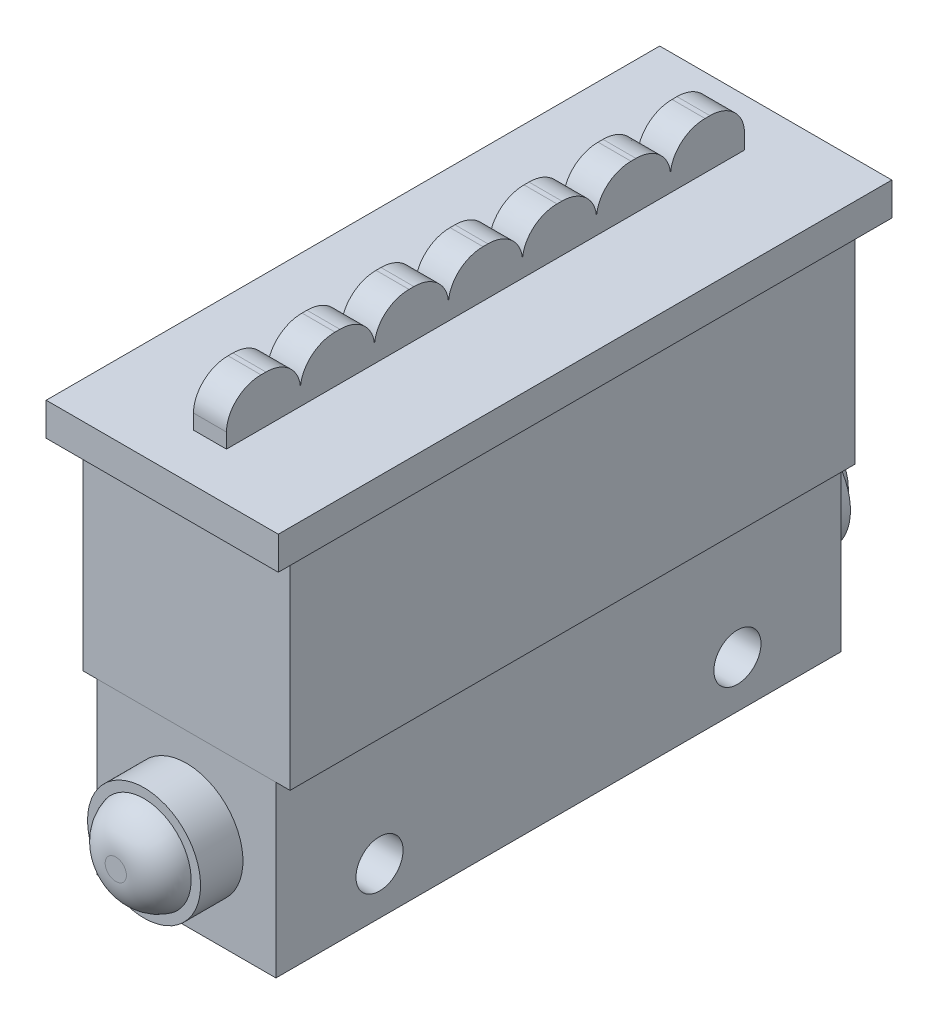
ISO-10303-21;
HEADER;
FILE_DESCRIPTION(('STEP AP214'),'2;1');
FILE_NAME('part.step','',(''),(''),'','','');
FILE_SCHEMA(('AUTOMOTIVE_DESIGN { 1 0 10303 214 1 1 1 1 }'));
ENDSEC;
DATA;
#1=APPLICATION_CONTEXT('core data for automotive mechanical design processes');
#2=APPLICATION_PROTOCOL_DEFINITION('international standard','automotive_design',2000,#1);
#3=PRODUCT_CONTEXT('',#1,'mechanical');
#4=PRODUCT('Part','Part','',(#3));
#5=PRODUCT_RELATED_PRODUCT_CATEGORY('part','',(#4));
#6=PRODUCT_DEFINITION_FORMATION('','',#4);
#7=PRODUCT_DEFINITION_CONTEXT('part definition',#1,'design');
#8=PRODUCT_DEFINITION('design','',#6,#7);
#9=PRODUCT_DEFINITION_SHAPE('','',#8);
#10=(LENGTH_UNIT() NAMED_UNIT(*) SI_UNIT(.MILLI.,.METRE.));
#11=(NAMED_UNIT(*) PLANE_ANGLE_UNIT() SI_UNIT($,.RADIAN.));
#12=(NAMED_UNIT(*) SI_UNIT($,.STERADIAN.) SOLID_ANGLE_UNIT());
#13=UNCERTAINTY_MEASURE_WITH_UNIT(LENGTH_MEASURE(1.E-05),#10,'distance_accuracy_value','');
#14=(GEOMETRIC_REPRESENTATION_CONTEXT(3) GLOBAL_UNCERTAINTY_ASSIGNED_CONTEXT((#13)) GLOBAL_UNIT_ASSIGNED_CONTEXT((#10,
#11,#12)) REPRESENTATION_CONTEXT('',''));
#15=CARTESIAN_POINT('',(0.,0.,0.));
#16=DIRECTION('',(0.,0.,1.));
#17=DIRECTION('',(1.,0.,0.));
#18=AXIS2_PLACEMENT_3D('',#15,#16,#17);
#19=CARTESIAN_POINT('',(1.75,30.5000015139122,-14.0238980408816));
#20=CARTESIAN_POINT('',(1.75,30.5000013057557,-12.0072983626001));
#21=CARTESIAN_POINT('',(1.75,28.9581015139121,-10.3571985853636));
#22=CARTESIAN_POINT('',(1.75,27.0737015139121,-10.3571985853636));
#23=B_SPLINE_CURVE_WITH_KNOTS('',3,(#19,#20,#21,#22),.UNSPECIFIED.,.F.,.F.,(4,4),
(0.925925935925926,1.),.UNSPECIFIED.);
#24=DIRECTION('',(-1.,0.,0.));
#25=VECTOR('',#24,1.);
#26=SURFACE_OF_LINEAR_EXTRUSION('',#23,#25);
#27=CARTESIAN_POINT('',(-1.75,30.5000015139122,-14.0238980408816));
#28=CARTESIAN_POINT('',(-1.75,30.5000013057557,-12.0072983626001));
#29=CARTESIAN_POINT('',(-1.75,28.9581015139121,-10.3571985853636));
#30=CARTESIAN_POINT('',(-1.75,27.0737015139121,-10.3571985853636));
#31=B_SPLINE_CURVE_WITH_KNOTS('',3,(#27,#28,#29,#30),.UNSPECIFIED.,.F.,.F.,(4,4),
(0.925925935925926,1.),.UNSPECIFIED.);
#32=CARTESIAN_POINT('',(-1.75,30.5000015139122,-14.0238980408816));
#33=VERTEX_POINT('',#32);
#34=CARTESIAN_POINT('',(-1.75,27.0737015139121,-10.3571985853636));
#35=VERTEX_POINT('',#34);
#36=EDGE_CURVE('E447',#33,#35,#31,.T.);
#37=ORIENTED_EDGE('',*,*,#36,.T.);
#38=DIRECTION('',(-1.,0.,0.));
#39=VECTOR('',#38,1.);
#40=CARTESIAN_POINT('',(1.75,27.0737015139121,-10.3571985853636));
#41=LINE('',#40,#39);
#42=CARTESIAN_POINT('',(1.75,27.0737015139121,-10.3571985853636));
#43=VERTEX_POINT('',#42);
#44=EDGE_CURVE('E12',#43,#35,#41,.T.);
#45=ORIENTED_EDGE('',*,*,#44,.F.);
#46=CARTESIAN_POINT('',(1.75,30.5000015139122,-14.0238980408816));
#47=VERTEX_POINT('',#46);
#48=EDGE_CURVE('E572',#47,#43,#23,.T.);
#49=ORIENTED_EDGE('',*,*,#48,.F.);
#50=DIRECTION('',(-1.,0.,0.));
#51=VECTOR('',#50,1.);
#52=CARTESIAN_POINT('',(1.75,30.5000015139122,-14.0238980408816));
#53=LINE('',#52,#51);
#54=EDGE_CURVE('E250',#47,#33,#53,.T.);
#55=ORIENTED_EDGE('',*,*,#54,.T.);
#56=EDGE_LOOP('',(#37,#45,#49,#55));
#57=FACE_BOUND('',#56,.T.);
#58=ADVANCED_FACE('F49',(#57),#26,.F.);
#59=CARTESIAN_POINT('',(1.75,27.0737015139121,-10.3571985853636));
#60=CARTESIAN_POINT('',(1.75,28.9581015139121,-10.3571985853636));
#61=CARTESIAN_POINT('',(1.75,30.5000015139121,-8.70719858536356));
#62=CARTESIAN_POINT('',(1.75,30.5000015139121,-6.69059858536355));
#63=B_SPLINE_CURVE_WITH_KNOTS('',3,(#59,#60,#61,#62),.UNSPECIFIED.,.F.,.F.,(4,4),(0.,
0.037037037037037),.UNSPECIFIED.);
#64=DIRECTION('',(-1.,0.,0.));
#65=VECTOR('',#64,1.);
#66=SURFACE_OF_LINEAR_EXTRUSION('',#63,#65);
#67=CARTESIAN_POINT('',(-1.75,27.0737015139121,-10.3571985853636));
#68=CARTESIAN_POINT('',(-1.75,28.9581015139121,-10.3571985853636));
#69=CARTESIAN_POINT('',(-1.75,30.5000015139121,-8.70719858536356));
#70=CARTESIAN_POINT('',(-1.75,30.5000015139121,-6.69059858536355));
#71=B_SPLINE_CURVE_WITH_KNOTS('',3,(#67,#68,#69,#70),.UNSPECIFIED.,.F.,.F.,(4,4),(0.,
0.037037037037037),.UNSPECIFIED.);
#72=CARTESIAN_POINT('',(-1.75,30.5000015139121,-6.69059858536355));
#73=VERTEX_POINT('',#72);
#74=EDGE_CURVE('E441',#35,#73,#71,.T.);
#75=ORIENTED_EDGE('',*,*,#74,.T.);
#76=DIRECTION('',(-1.,0.,0.));
#77=VECTOR('',#76,1.);
#78=CARTESIAN_POINT('',(1.75,30.5000015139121,-6.69059858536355));
#79=LINE('',#78,#77);
#80=CARTESIAN_POINT('',(1.75,30.5000015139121,-6.69059858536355));
#81=VERTEX_POINT('',#80);
#82=EDGE_CURVE('E58',#81,#73,#79,.T.);
#83=ORIENTED_EDGE('',*,*,#82,.F.);
#84=EDGE_CURVE('E163',#43,#81,#63,.T.);
#85=ORIENTED_EDGE('',*,*,#84,.F.);
#86=ORIENTED_EDGE('',*,*,#44,.T.);
#87=EDGE_LOOP('',(#75,#83,#85,#86));
#88=FACE_BOUND('',#87,.T.);
#89=ADVANCED_FACE('F597',(#88),#66,.F.);
#90=CARTESIAN_POINT('',(1.75,30.5000015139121,-6.16679749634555));
#91=DIRECTION('',(0.,-1.,0.));
#92=DIRECTION('',(0.,0.,-1.));
#93=AXIS2_PLACEMENT_3D('',#90,#91,#92);
#94=PLANE('',#93);
#95=DIRECTION('',(0.,0.,1.));
#96=VECTOR('',#95,1.);
#97=CARTESIAN_POINT('',(-1.75,30.5000015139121,-6.16679749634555));
#98=LINE('',#97,#96);
#99=CARTESIAN_POINT('',(-1.75,30.5000015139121,-6.16679749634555));
#100=VERTEX_POINT('',#99);
#101=EDGE_CURVE('E435',#73,#100,#98,.T.);
#102=ORIENTED_EDGE('',*,*,#101,.T.);
#103=DIRECTION('',(-1.,0.,0.));
#104=VECTOR('',#103,1.);
#105=CARTESIAN_POINT('',(1.75,30.5000015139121,-6.16679749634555));
#106=LINE('',#105,#104);
#107=CARTESIAN_POINT('',(1.75,30.5000015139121,-6.16679749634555));
#108=VERTEX_POINT('',#107);
#109=EDGE_CURVE('E427',#108,#100,#106,.T.);
#110=ORIENTED_EDGE('',*,*,#109,.F.);
#111=DIRECTION('',(0.,0.,1.));
#112=VECTOR('',#111,1.);
#113=CARTESIAN_POINT('',(1.75,30.5000015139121,-6.16679749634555));
#114=LINE('',#113,#112);
#115=EDGE_CURVE('E436',#81,#108,#114,.T.);
#116=ORIENTED_EDGE('',*,*,#115,.F.);
#117=ORIENTED_EDGE('',*,*,#82,.T.);
#118=EDGE_LOOP('',(#102,#110,#116,#117));
#119=FACE_BOUND('',#118,.T.);
#120=ADVANCED_FACE('F433',(#119),#94,.F.);
#121=CARTESIAN_POINT('',(1.75,30.5000015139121,-6.16679749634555));
#122=CARTESIAN_POINT('',(1.75,30.5000010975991,-4.15009813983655));
#123=CARTESIAN_POINT('',(1.75,28.958101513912,-2.49999858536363));
#124=CARTESIAN_POINT('',(1.75,27.073701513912,-2.4999985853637));
#125=B_SPLINE_CURVE_WITH_KNOTS('',3,(#121,#122,#123,#124),.UNSPECIFIED.,.F.,.F.,(4,4),
(0.0740740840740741,0.111111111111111),.UNSPECIFIED.);
#126=DIRECTION('',(-1.,0.,0.));
#127=VECTOR('',#126,1.);
#128=SURFACE_OF_LINEAR_EXTRUSION('',#125,#127);
#129=CARTESIAN_POINT('',(-1.75,30.5000015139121,-6.16679749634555));
#130=CARTESIAN_POINT('',(-1.75,30.5000010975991,-4.15009813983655));
#131=CARTESIAN_POINT('',(-1.75,28.958101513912,-2.49999858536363));
#132=CARTESIAN_POINT('',(-1.75,27.073701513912,-2.4999985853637));
#133=B_SPLINE_CURVE_WITH_KNOTS('',3,(#129,#130,#131,#132),.UNSPECIFIED.,.F.,.F.,(4,4),
(0.0740740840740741,0.111111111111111),.UNSPECIFIED.);
#134=CARTESIAN_POINT('',(-1.75,27.073701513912,-2.4999985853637));
#135=VERTEX_POINT('',#134);
#136=EDGE_CURVE('E443',#100,#135,#133,.T.);
#137=ORIENTED_EDGE('',*,*,#136,.T.);
#138=DIRECTION('',(-1.,0.,0.));
#139=VECTOR('',#138,1.);
#140=CARTESIAN_POINT('',(1.75,27.073701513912,-2.4999985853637));
#141=LINE('',#140,#139);
#142=CARTESIAN_POINT('',(1.75,27.073701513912,-2.4999985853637));
#143=VERTEX_POINT('',#142);
#144=EDGE_CURVE('E424',#143,#135,#141,.T.);
#145=ORIENTED_EDGE('',*,*,#144,.F.);
#146=EDGE_CURVE('E608',#108,#143,#125,.T.);
#147=ORIENTED_EDGE('',*,*,#146,.F.);
#148=ORIENTED_EDGE('',*,*,#109,.T.);
#149=EDGE_LOOP('',(#137,#145,#147,#148));
#150=FACE_BOUND('',#149,.T.);
#151=ADVANCED_FACE('F602',(#150),#128,.F.);
#152=CARTESIAN_POINT('',(1.75,25.5000015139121,-2.49999858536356));
#153=DIRECTION('',(0.,0.,-1.));
#154=DIRECTION('',(-1.,0.,0.));
#155=AXIS2_PLACEMENT_3D('',#152,#153,#154);
#156=PLANE('',#155);
#157=CARTESIAN_POINT('',(-1.75,25.5000015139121,-2.49999858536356));
#158=CARTESIAN_POINT('',(-1.75,25.5000005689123,-2.49999858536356));
#159=CARTESIAN_POINT('',(-1.75,22.0000015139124,-2.49999858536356));
#160=B_SPLINE_CURVE_WITH_KNOTS('',2,(#157,#158,#159),.UNSPECIFIED.,.F.,.F.,(3,3),
(0.148148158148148,0.185185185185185),.UNSPECIFIED.);
#161=CARTESIAN_POINT('',(-1.75,25.5000015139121,-2.49999858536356));
#162=VERTEX_POINT('',#161);
#163=CARTESIAN_POINT('',(-1.75,22.0000015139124,-2.49999858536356));
#164=VERTEX_POINT('',#163);
#165=EDGE_CURVE('E460',#162,#164,#160,.T.);
#166=ORIENTED_EDGE('',*,*,#165,.T.);
#167=DIRECTION('',(-1.,0.,0.));
#168=VECTOR('',#167,1.);
#169=CARTESIAN_POINT('',(1.75,22.0000015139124,-2.49999858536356));
#170=LINE('',#169,#168);
#171=CARTESIAN_POINT('',(1.75,22.0000015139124,-2.49999858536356));
#172=VERTEX_POINT('',#171);
#173=EDGE_CURVE('E421',#172,#164,#170,.T.);
#174=ORIENTED_EDGE('',*,*,#173,.F.);
#175=CARTESIAN_POINT('',(1.75,25.5000015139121,-2.49999858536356));
#176=CARTESIAN_POINT('',(1.75,25.5000005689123,-2.49999858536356));
#177=CARTESIAN_POINT('',(1.75,22.0000015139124,-2.49999858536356));
#178=B_SPLINE_CURVE_WITH_KNOTS('',2,(#175,#176,#177),.UNSPECIFIED.,.F.,.F.,(3,3),
(0.148148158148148,0.185185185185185),.UNSPECIFIED.);
#179=CARTESIAN_POINT('',(1.75,25.5000015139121,-2.49999858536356));
#180=VERTEX_POINT('',#179);
#181=EDGE_CURVE('E620',#180,#172,#178,.T.);
#182=ORIENTED_EDGE('',*,*,#181,.F.);
#183=CARTESIAN_POINT('',(1.75,27.073701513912,-2.4999985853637));
#184=CARTESIAN_POINT('',(1.75,27.0737010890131,-2.49999858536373));
#185=CARTESIAN_POINT('',(1.75,25.5000015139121,-2.49999858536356));
#186=B_SPLINE_CURVE_WITH_KNOTS('',2,(#183,#184,#185),.UNSPECIFIED.,.F.,.F.,(3,3),
(0.111111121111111,0.148148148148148),.UNSPECIFIED.);
#187=EDGE_CURVE('E613',#143,#180,#186,.T.);
#188=ORIENTED_EDGE('',*,*,#187,.F.);
#189=ORIENTED_EDGE('',*,*,#144,.T.);
#190=CARTESIAN_POINT('',(-1.75,27.073701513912,-2.4999985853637));
#191=CARTESIAN_POINT('',(-1.75,27.0737010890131,-2.49999858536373));
#192=CARTESIAN_POINT('',(-1.75,25.5000015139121,-2.49999858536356));
#193=B_SPLINE_CURVE_WITH_KNOTS('',2,(#190,#191,#192),.UNSPECIFIED.,.F.,.F.,(3,3),
(0.111111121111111,0.148148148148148),.UNSPECIFIED.);
#194=EDGE_CURVE('E445',#135,#162,#193,.T.);
#195=ORIENTED_EDGE('',*,*,#194,.T.);
#196=EDGE_LOOP('',(#166,#174,#182,#188,#189,#195));
#197=FACE_BOUND('',#196,.T.);
#198=ADVANCED_FACE('F605',(#197),#156,.F.);
#199=CARTESIAN_POINT('',(1.75,22.0000015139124,-2.49999858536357));
#200=DIRECTION('',(0.,0.999999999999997,8.34824530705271E-08));
#201=DIRECTION('',(0.,-8.34824530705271E-08,0.999999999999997));
#202=AXIS2_PLACEMENT_3D('',#199,#200,#201);
#203=PLANE('',#202);
#204=CARTESIAN_POINT('',(-1.75,22.0000015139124,-2.49999858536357));
#205=CARTESIAN_POINT('',(-1.75,22.0000015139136,-2.50001343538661));
#206=CARTESIAN_POINT('',(-1.75,22.0000061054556,-57.5000985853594));
#207=B_SPLINE_CURVE_WITH_KNOTS('',2,(#204,#205,#206),.UNSPECIFIED.,.F.,.F.,(3,3),
(0.185185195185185,0.222222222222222),.UNSPECIFIED.);
#208=CARTESIAN_POINT('',(-1.75,22.0000061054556,-57.5000985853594));
#209=VERTEX_POINT('',#208);
#210=EDGE_CURVE('E467',#164,#209,#207,.T.);
#211=ORIENTED_EDGE('',*,*,#210,.T.);
#212=DIRECTION('',(-1.,0.,0.));
#213=VECTOR('',#212,1.);
#214=CARTESIAN_POINT('',(1.75,22.0000061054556,-57.5000985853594));
#215=LINE('',#214,#213);
#216=CARTESIAN_POINT('',(1.75,22.0000061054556,-57.5000985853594));
#217=VERTEX_POINT('',#216);
#218=EDGE_CURVE('E418',#217,#209,#215,.T.);
#219=ORIENTED_EDGE('',*,*,#218,.F.);
#220=CARTESIAN_POINT('',(1.75,22.0000015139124,-2.49999858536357));
#221=CARTESIAN_POINT('',(1.75,22.0000015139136,-2.50001343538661));
#222=CARTESIAN_POINT('',(1.75,22.0000061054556,-57.5000985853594));
#223=B_SPLINE_CURVE_WITH_KNOTS('',2,(#220,#221,#222),.UNSPECIFIED.,.F.,.F.,(3,3),
(0.185185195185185,0.222222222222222),.UNSPECIFIED.);
#224=EDGE_CURVE('E627',#172,#217,#223,.T.);
#225=ORIENTED_EDGE('',*,*,#224,.F.);
#226=ORIENTED_EDGE('',*,*,#173,.T.);
#227=EDGE_LOOP('',(#211,#219,#225,#226));
#228=FACE_BOUND('',#227,.T.);
#229=ADVANCED_FACE('F671',(#228),#203,.F.);
#230=CARTESIAN_POINT('',(1.75,25.5000061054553,-57.5000992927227));
#231=DIRECTION('',(0.,0.,1.));
#232=DIRECTION('',(1.,0.,0.));
#233=AXIS2_PLACEMENT_3D('',#230,#231,#232);
#234=PLANE('',#233);
#235=CARTESIAN_POINT('',(-1.75,25.5000061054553,-57.5000992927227));
#236=CARTESIAN_POINT('',(-1.75,25.5000065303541,-57.5000992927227));
#237=CARTESIAN_POINT('',(-1.75,27.0737061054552,-57.5000992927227));
#238=B_SPLINE_CURVE_WITH_KNOTS('',2,(#235,#236,#237),.UNSPECIFIED.,.F.,.F.,(3,3),
(0.259259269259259,0.296296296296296),.UNSPECIFIED.);
#239=CARTESIAN_POINT('',(-1.75,25.5000061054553,-57.5000992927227));
#240=VERTEX_POINT('',#239);
#241=CARTESIAN_POINT('',(-1.75,27.0737061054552,-57.5000992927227));
#242=VERTEX_POINT('',#241);
#243=EDGE_CURVE('E481',#240,#242,#238,.T.);
#244=ORIENTED_EDGE('',*,*,#243,.T.);
#245=DIRECTION('',(-1.,0.,0.));
#246=VECTOR('',#245,1.);
#247=CARTESIAN_POINT('',(1.75,27.0737061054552,-57.5000992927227));
#248=LINE('',#247,#246);
#249=CARTESIAN_POINT('',(1.75,27.0737061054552,-57.5000992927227));
#250=VERTEX_POINT('',#249);
#251=EDGE_CURVE('E415',#250,#242,#248,.T.);
#252=ORIENTED_EDGE('',*,*,#251,.F.);
#253=CARTESIAN_POINT('',(1.75,25.5000061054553,-57.5000992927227));
#254=CARTESIAN_POINT('',(1.75,25.5000065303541,-57.5000992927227));
#255=CARTESIAN_POINT('',(1.75,27.0737061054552,-57.5000992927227));
#256=B_SPLINE_CURVE_WITH_KNOTS('',2,(#253,#254,#255),.UNSPECIFIED.,.F.,.F.,(3,3),
(0.259259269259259,0.296296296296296),.UNSPECIFIED.);
#257=CARTESIAN_POINT('',(1.75,25.5000061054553,-57.5000992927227));
#258=VERTEX_POINT('',#257);
#259=EDGE_CURVE('E641',#258,#250,#256,.T.);
#260=ORIENTED_EDGE('',*,*,#259,.F.);
#261=CARTESIAN_POINT('',(1.75,22.0000061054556,-57.5000985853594));
#262=CARTESIAN_POINT('',(1.75,22.0000070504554,-57.5000985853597));
#263=CARTESIAN_POINT('',(1.75,25.5000061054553,-57.5000992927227));
#264=B_SPLINE_CURVE_WITH_KNOTS('',2,(#261,#262,#263),.UNSPECIFIED.,.F.,.F.,(3,3),
(0.222222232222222,0.259259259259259),.UNSPECIFIED.);
#265=EDGE_CURVE('E634',#217,#258,#264,.T.);
#266=ORIENTED_EDGE('',*,*,#265,.F.);
#267=ORIENTED_EDGE('',*,*,#218,.T.);
#268=CARTESIAN_POINT('',(-1.75,22.0000061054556,-57.5000985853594));
#269=CARTESIAN_POINT('',(-1.75,22.0000070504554,-57.5000985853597));
#270=CARTESIAN_POINT('',(-1.75,25.5000061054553,-57.5000992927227));
#271=B_SPLINE_CURVE_WITH_KNOTS('',2,(#268,#269,#270),.UNSPECIFIED.,.F.,.F.,(3,3),
(0.222222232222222,0.259259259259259),.UNSPECIFIED.);
#272=EDGE_CURVE('E474',#209,#240,#271,.T.);
#273=ORIENTED_EDGE('',*,*,#272,.T.);
#274=EDGE_LOOP('',(#244,#252,#260,#266,#267,#273));
#275=FACE_BOUND('',#274,.T.);
#276=ADVANCED_FACE('F667',(#275),#234,.F.);
#277=CARTESIAN_POINT('',(1.75,27.0737061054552,-57.5000992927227));
#278=CARTESIAN_POINT('',(1.75,28.9581055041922,-57.5000988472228));
#279=CARTESIAN_POINT('',(1.75,30.5000050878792,-55.850099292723));
#280=CARTESIAN_POINT('',(1.75,30.5000050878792,-53.833399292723));
#281=B_SPLINE_CURVE_WITH_KNOTS('',3,(#277,#278,#279,#280),.UNSPECIFIED.,.F.,.F.,(4,4),
(0.296296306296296,0.333333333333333),.UNSPECIFIED.);
#282=DIRECTION('',(-1.,0.,0.));
#283=VECTOR('',#282,1.);
#284=SURFACE_OF_LINEAR_EXTRUSION('',#281,#283);
#285=CARTESIAN_POINT('',(-1.75,27.0737061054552,-57.5000992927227));
#286=CARTESIAN_POINT('',(-1.75,28.9581055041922,-57.5000988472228));
#287=CARTESIAN_POINT('',(-1.75,30.5000050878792,-55.850099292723));
#288=CARTESIAN_POINT('',(-1.75,30.5000050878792,-53.833399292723));
#289=B_SPLINE_CURVE_WITH_KNOTS('',3,(#285,#286,#287,#288),.UNSPECIFIED.,.F.,.F.,(4,4),
(0.296296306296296,0.333333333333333),.UNSPECIFIED.);
#290=CARTESIAN_POINT('',(-1.75,30.5000050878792,-53.833399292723));
#291=VERTEX_POINT('',#290);
#292=EDGE_CURVE('E488',#242,#291,#289,.T.);
#293=ORIENTED_EDGE('',*,*,#292,.T.);
#294=DIRECTION('',(-1.,0.,0.));
#295=VECTOR('',#294,1.);
#296=CARTESIAN_POINT('',(1.75,30.5000050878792,-53.833399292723));
#297=LINE('',#296,#295);
#298=CARTESIAN_POINT('',(1.75,30.5000050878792,-53.833399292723));
#299=VERTEX_POINT('',#298);
#300=EDGE_CURVE('E412',#299,#291,#297,.T.);
#301=ORIENTED_EDGE('',*,*,#300,.F.);
#302=EDGE_CURVE('E648',#250,#299,#281,.T.);
#303=ORIENTED_EDGE('',*,*,#302,.F.);
#304=ORIENTED_EDGE('',*,*,#251,.T.);
#305=EDGE_LOOP('',(#293,#301,#303,#304));
#306=FACE_BOUND('',#305,.T.);
#307=ADVANCED_FACE('F662',(#306),#284,.F.);
#308=CARTESIAN_POINT('',(1.75,30.5000050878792,-53.3095989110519));
#309=DIRECTION('',(0.,-1.,0.));
#310=DIRECTION('',(0.,0.,-1.));
#311=AXIS2_PLACEMENT_3D('',#308,#309,#310);
#312=PLANE('',#311);
#313=DIRECTION('',(0.,0.,1.));
#314=VECTOR('',#313,1.);
#315=CARTESIAN_POINT('',(-1.75,30.5000050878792,-53.3095989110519));
#316=LINE('',#315,#314);
#317=CARTESIAN_POINT('',(-1.75,30.5000050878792,-53.3095989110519));
#318=VERTEX_POINT('',#317);
#319=EDGE_CURVE('E495',#291,#318,#316,.T.);
#320=ORIENTED_EDGE('',*,*,#319,.T.);
#321=DIRECTION('',(-1.,0.,0.));
#322=VECTOR('',#321,1.);
#323=CARTESIAN_POINT('',(1.75,30.5000050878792,-53.3095989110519));
#324=LINE('',#323,#322);
#325=CARTESIAN_POINT('',(1.75,30.5000050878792,-53.3095989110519));
#326=VERTEX_POINT('',#325);
#327=EDGE_CURVE('E409',#326,#318,#324,.T.);
#328=ORIENTED_EDGE('',*,*,#327,.F.);
#329=DIRECTION('',(0.,0.,1.));
#330=VECTOR('',#329,1.);
#331=CARTESIAN_POINT('',(1.75,30.5000050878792,-53.3095989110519));
#332=LINE('',#331,#330);
#333=EDGE_CURVE('E656',#299,#326,#332,.T.);
#334=ORIENTED_EDGE('',*,*,#333,.F.);
#335=ORIENTED_EDGE('',*,*,#300,.T.);
#336=EDGE_LOOP('',(#320,#328,#334,#335));
#337=FACE_BOUND('',#336,.T.);
#338=ADVANCED_FACE('F666',(#337),#312,.F.);
#339=CARTESIAN_POINT('',(1.75,30.5000050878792,-53.3095989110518));
#340=CARTESIAN_POINT('',(1.75,30.5000050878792,-51.2929995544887));
#341=CARTESIAN_POINT('',(1.75,28.9581058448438,-49.6428996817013));
#342=CARTESIAN_POINT('',(1.75,27.0737058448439,-49.64289929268));
#343=B_SPLINE_CURVE_WITH_KNOTS('',3,(#339,#340,#341,#342),.UNSPECIFIED.,.F.,.F.,(4,4),
(0.37037038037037,0.407407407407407),.UNSPECIFIED.);
#344=DIRECTION('',(-1.,0.,0.));
#345=VECTOR('',#344,1.);
#346=SURFACE_OF_LINEAR_EXTRUSION('',#343,#345);
#347=CARTESIAN_POINT('',(-1.75,30.5000050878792,-53.3095989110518));
#348=CARTESIAN_POINT('',(-1.75,30.5000050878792,-51.2929995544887));
#349=CARTESIAN_POINT('',(-1.75,28.9581058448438,-49.6428996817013));
#350=CARTESIAN_POINT('',(-1.75,27.0737058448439,-49.64289929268));
#351=B_SPLINE_CURVE_WITH_KNOTS('',3,(#347,#348,#349,#350),.UNSPECIFIED.,.F.,.F.,(4,4),
(0.37037038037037,0.407407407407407),.UNSPECIFIED.);
#352=CARTESIAN_POINT('',(-1.75,27.0737058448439,-49.64289929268));
#353=VERTEX_POINT('',#352);
#354=EDGE_CURVE('E500',#318,#353,#351,.T.);
#355=ORIENTED_EDGE('',*,*,#354,.T.);
#356=DIRECTION('',(-1.,0.,0.));
#357=VECTOR('',#356,1.);
#358=CARTESIAN_POINT('',(1.75,27.0737058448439,-49.64289929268));
#359=LINE('',#358,#357);
#360=CARTESIAN_POINT('',(1.75,27.0737058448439,-49.64289929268));
#361=VERTEX_POINT('',#360);
#362=EDGE_CURVE('E406',#361,#353,#359,.T.);
#363=ORIENTED_EDGE('',*,*,#362,.F.);
#364=EDGE_CURVE('E860',#326,#361,#343,.T.);
#365=ORIENTED_EDGE('',*,*,#364,.F.);
#366=ORIENTED_EDGE('',*,*,#327,.T.);
#367=EDGE_LOOP('',(#355,#363,#365,#366));
#368=FACE_BOUND('',#367,.T.);
#369=ADVANCED_FACE('F725',(#368),#346,.F.);
#370=CARTESIAN_POINT('',(1.75,27.0737058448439,-49.64289929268));
#371=CARTESIAN_POINT('',(1.75,28.9581052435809,-49.6428988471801));
#372=CARTESIAN_POINT('',(1.75,30.5000048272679,-47.9928992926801));
#373=CARTESIAN_POINT('',(1.75,30.5000048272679,-45.9762992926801));
#374=B_SPLINE_CURVE_WITH_KNOTS('',3,(#370,#371,#372,#373),.UNSPECIFIED.,.F.,.F.,(4,4),
(0.407407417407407,0.444444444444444),.UNSPECIFIED.);
#375=DIRECTION('',(-1.,0.,0.));
#376=VECTOR('',#375,1.);
#377=SURFACE_OF_LINEAR_EXTRUSION('',#374,#376);
#378=CARTESIAN_POINT('',(-1.75,27.0737058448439,-49.64289929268));
#379=CARTESIAN_POINT('',(-1.75,28.9581052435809,-49.6428988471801));
#380=CARTESIAN_POINT('',(-1.75,30.5000048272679,-47.9928992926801));
#381=CARTESIAN_POINT('',(-1.75,30.5000048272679,-45.9762992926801));
#382=B_SPLINE_CURVE_WITH_KNOTS('',3,(#378,#379,#380,#381),.UNSPECIFIED.,.F.,.F.,(4,4),
(0.407407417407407,0.444444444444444),.UNSPECIFIED.);
#383=CARTESIAN_POINT('',(-1.75,30.5000048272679,-45.9762992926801));
#384=VERTEX_POINT('',#383);
#385=EDGE_CURVE('E504',#353,#384,#382,.T.);
#386=ORIENTED_EDGE('',*,*,#385,.T.);
#387=DIRECTION('',(-1.,0.,0.));
#388=VECTOR('',#387,1.);
#389=CARTESIAN_POINT('',(1.75,30.5000048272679,-45.9762992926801));
#390=LINE('',#389,#388);
#391=CARTESIAN_POINT('',(1.75,30.5000048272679,-45.9762992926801));
#392=VERTEX_POINT('',#391);
#393=EDGE_CURVE('E403',#392,#384,#390,.T.);
#394=ORIENTED_EDGE('',*,*,#393,.F.);
#395=EDGE_CURVE('E859',#361,#392,#374,.T.);
#396=ORIENTED_EDGE('',*,*,#395,.F.);
#397=ORIENTED_EDGE('',*,*,#362,.T.);
#398=EDGE_LOOP('',(#386,#394,#396,#397));
#399=FACE_BOUND('',#398,.T.);
#400=ADVANCED_FACE('F734',(#399),#377,.F.);
#401=CARTESIAN_POINT('',(1.75,30.5000048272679,-45.4524982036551));
#402=DIRECTION('',(0.,-1.,0.));
#403=DIRECTION('',(0.,0.,-1.));
#404=AXIS2_PLACEMENT_3D('',#401,#402,#403);
#405=PLANE('',#404);
#406=DIRECTION('',(0.,0.,1.));
#407=VECTOR('',#406,1.);
#408=CARTESIAN_POINT('',(-1.75,30.5000048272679,-45.4524982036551));
#409=LINE('',#408,#407);
#410=CARTESIAN_POINT('',(-1.75,30.5000048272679,-45.4524982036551));
#411=VERTEX_POINT('',#410);
#412=EDGE_CURVE('E511',#384,#411,#409,.T.);
#413=ORIENTED_EDGE('',*,*,#412,.T.);
#414=DIRECTION('',(-1.,0.,0.));
#415=VECTOR('',#414,1.);
#416=CARTESIAN_POINT('',(1.75,30.5000048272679,-45.4524982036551));
#417=LINE('',#416,#415);
#418=CARTESIAN_POINT('',(1.75,30.5000048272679,-45.4524982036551));
#419=VERTEX_POINT('',#418);
#420=EDGE_CURVE('E400',#419,#411,#417,.T.);
#421=ORIENTED_EDGE('',*,*,#420,.F.);
#422=DIRECTION('',(0.,0.,1.));
#423=VECTOR('',#422,1.);
#424=CARTESIAN_POINT('',(1.75,30.5000048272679,-45.4524982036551));
#425=LINE('',#424,#423);
#426=EDGE_CURVE('E858',#392,#419,#425,.T.);
#427=ORIENTED_EDGE('',*,*,#426,.F.);
#428=ORIENTED_EDGE('',*,*,#393,.T.);
#429=EDGE_LOOP('',(#413,#421,#427,#428));
#430=FACE_BOUND('',#429,.T.);
#431=ADVANCED_FACE('F743',(#430),#405,.F.);
#432=CARTESIAN_POINT('',(1.75,30.5000048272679,-45.4524982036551));
#433=CARTESIAN_POINT('',(1.75,30.500004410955,-43.435798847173));
#434=CARTESIAN_POINT('',(1.75,28.958104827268,-41.7857992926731));
#435=CARTESIAN_POINT('',(1.75,27.073704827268,-41.7857992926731));
#436=B_SPLINE_CURVE_WITH_KNOTS('',3,(#432,#433,#434,#435),.UNSPECIFIED.,.F.,.F.,(4,4),
(0.481481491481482,0.518518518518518),.UNSPECIFIED.);
#437=DIRECTION('',(-1.,0.,0.));
#438=VECTOR('',#437,1.);
#439=SURFACE_OF_LINEAR_EXTRUSION('',#436,#438);
#440=CARTESIAN_POINT('',(-1.75,30.5000048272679,-45.4524982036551));
#441=CARTESIAN_POINT('',(-1.75,30.500004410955,-43.435798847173));
#442=CARTESIAN_POINT('',(-1.75,28.958104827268,-41.7857992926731));
#443=CARTESIAN_POINT('',(-1.75,27.073704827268,-41.7857992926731));
#444=B_SPLINE_CURVE_WITH_KNOTS('',3,(#440,#441,#442,#443),.UNSPECIFIED.,.F.,.F.,(4,4),
(0.481481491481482,0.518518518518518),.UNSPECIFIED.);
#445=CARTESIAN_POINT('',(-1.75,27.073704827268,-41.7857992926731));
#446=VERTEX_POINT('',#445);
#447=EDGE_CURVE('E516',#411,#446,#444,.T.);
#448=ORIENTED_EDGE('',*,*,#447,.T.);
#449=DIRECTION('',(-1.,0.,0.));
#450=VECTOR('',#449,1.);
#451=CARTESIAN_POINT('',(1.75,27.073704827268,-41.7857992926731));
#452=LINE('',#451,#450);
#453=CARTESIAN_POINT('',(1.75,27.073704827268,-41.7857992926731));
#454=VERTEX_POINT('',#453);
#455=EDGE_CURVE('E397',#454,#446,#452,.T.);
#456=ORIENTED_EDGE('',*,*,#455,.F.);
#457=EDGE_CURVE('E340',#419,#454,#436,.T.);
#458=ORIENTED_EDGE('',*,*,#457,.F.);
#459=ORIENTED_EDGE('',*,*,#420,.T.);
#460=EDGE_LOOP('',(#448,#456,#458,#459));
#461=FACE_BOUND('',#460,.T.);
#462=ADVANCED_FACE('F331',(#461),#439,.F.);
#463=CARTESIAN_POINT('',(1.75,27.073704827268,-41.7857992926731));
#464=CARTESIAN_POINT('',(1.75,28.9581042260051,-41.7857988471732));
#465=CARTESIAN_POINT('',(1.75,30.5000038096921,-40.1357992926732));
#466=CARTESIAN_POINT('',(1.75,30.5000038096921,-38.1190992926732));
#467=B_SPLINE_CURVE_WITH_KNOTS('',3,(#463,#464,#465,#466),.UNSPECIFIED.,.F.,.F.,(4,4),
(0.518518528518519,0.555555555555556),.UNSPECIFIED.);
#468=DIRECTION('',(-1.,0.,0.));
#469=VECTOR('',#468,1.);
#470=SURFACE_OF_LINEAR_EXTRUSION('',#467,#469);
#471=CARTESIAN_POINT('',(-1.75,27.073704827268,-41.7857992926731));
#472=CARTESIAN_POINT('',(-1.75,28.9581042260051,-41.7857988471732));
#473=CARTESIAN_POINT('',(-1.75,30.5000038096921,-40.1357992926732));
#474=CARTESIAN_POINT('',(-1.75,30.5000038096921,-38.1190992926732));
#475=B_SPLINE_CURVE_WITH_KNOTS('',3,(#471,#472,#473,#474),.UNSPECIFIED.,.F.,.F.,(4,4),
(0.518518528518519,0.555555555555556),.UNSPECIFIED.);
#476=CARTESIAN_POINT('',(-1.75,30.5000038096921,-38.1190992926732));
#477=VERTEX_POINT('',#476);
#478=EDGE_CURVE('E520',#446,#477,#475,.T.);
#479=ORIENTED_EDGE('',*,*,#478,.T.);
#480=DIRECTION('',(-1.,0.,0.));
#481=VECTOR('',#480,1.);
#482=CARTESIAN_POINT('',(1.75,30.5000038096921,-38.1190992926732));
#483=LINE('',#482,#481);
#484=CARTESIAN_POINT('',(1.75,30.5000038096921,-38.1190992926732));
#485=VERTEX_POINT('',#484);
#486=EDGE_CURVE('E394',#485,#477,#483,.T.);
#487=ORIENTED_EDGE('',*,*,#486,.F.);
#488=EDGE_CURVE('E335',#454,#485,#467,.T.);
#489=ORIENTED_EDGE('',*,*,#488,.F.);
#490=ORIENTED_EDGE('',*,*,#455,.T.);
#491=EDGE_LOOP('',(#479,#487,#489,#490));
#492=FACE_BOUND('',#491,.T.);
#493=ADVANCED_FACE('F326',(#492),#470,.F.);
#494=CARTESIAN_POINT('',(1.75,30.5000038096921,-37.5953982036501));
#495=DIRECTION('',(0.,-1.,0.));
#496=DIRECTION('',(0.,0.,-1.));
#497=AXIS2_PLACEMENT_3D('',#494,#495,#496);
#498=PLANE('',#497);
#499=DIRECTION('',(0.,0.,1.));
#500=VECTOR('',#499,1.);
#501=CARTESIAN_POINT('',(-1.75,30.5000038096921,-37.5953982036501));
#502=LINE('',#501,#500);
#503=CARTESIAN_POINT('',(-1.75,30.5000038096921,-37.5953982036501));
#504=VERTEX_POINT('',#503);
#505=EDGE_CURVE('E527',#477,#504,#502,.T.);
#506=ORIENTED_EDGE('',*,*,#505,.T.);
#507=DIRECTION('',(-1.,0.,0.));
#508=VECTOR('',#507,1.);
#509=CARTESIAN_POINT('',(1.75,30.5000038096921,-37.5953982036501));
#510=LINE('',#509,#508);
#511=CARTESIAN_POINT('',(1.75,30.5000038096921,-37.5953982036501));
#512=VERTEX_POINT('',#511);
#513=EDGE_CURVE('E360',#512,#504,#510,.T.);
#514=ORIENTED_EDGE('',*,*,#513,.F.);
#515=DIRECTION('',(0.,0.,1.));
#516=VECTOR('',#515,1.);
#517=CARTESIAN_POINT('',(1.75,30.5000038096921,-37.5953982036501));
#518=LINE('',#517,#516);
#519=EDGE_CURVE('E339',#485,#512,#518,.T.);
#520=ORIENTED_EDGE('',*,*,#519,.F.);
#521=ORIENTED_EDGE('',*,*,#486,.T.);
#522=EDGE_LOOP('',(#506,#514,#520,#521));
#523=FACE_BOUND('',#522,.T.);
#524=ADVANCED_FACE('F322',(#523),#498,.F.);
#525=CARTESIAN_POINT('',(1.75,30.5000038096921,-37.5953982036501));
#526=CARTESIAN_POINT('',(1.75,30.5000038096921,-35.578698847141));
#527=CARTESIAN_POINT('',(1.75,28.9581045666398,-33.9285989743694));
#528=CARTESIAN_POINT('',(1.75,27.0737045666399,-33.9285985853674));
#529=B_SPLINE_CURVE_WITH_KNOTS('',3,(#525,#526,#527,#528),.UNSPECIFIED.,.F.,.F.,(4,4),
(0.592592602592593,0.62962962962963),.UNSPECIFIED.);
#530=DIRECTION('',(-1.,0.,0.));
#531=VECTOR('',#530,1.);
#532=SURFACE_OF_LINEAR_EXTRUSION('',#529,#531);
#533=CARTESIAN_POINT('',(-1.75,30.5000038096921,-37.5953982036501));
#534=CARTESIAN_POINT('',(-1.75,30.5000038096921,-35.578698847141));
#535=CARTESIAN_POINT('',(-1.75,28.9581045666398,-33.9285989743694));
#536=CARTESIAN_POINT('',(-1.75,27.0737045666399,-33.9285985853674));
#537=B_SPLINE_CURVE_WITH_KNOTS('',3,(#533,#534,#535,#536),.UNSPECIFIED.,.F.,.F.,(4,4),
(0.592592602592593,0.62962962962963),.UNSPECIFIED.);
#538=CARTESIAN_POINT('',(-1.75,27.0737045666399,-33.9285985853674));
#539=VERTEX_POINT('',#538);
#540=EDGE_CURVE('E358',#504,#539,#537,.T.);
#541=ORIENTED_EDGE('',*,*,#540,.T.);
#542=DIRECTION('',(-1.,0.,0.));
#543=VECTOR('',#542,1.);
#544=CARTESIAN_POINT('',(1.75,27.0737045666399,-33.9285985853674));
#545=LINE('',#544,#543);
#546=CARTESIAN_POINT('',(1.75,27.0737045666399,-33.9285985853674));
#547=VERTEX_POINT('',#546);
#548=EDGE_CURVE('E356',#547,#539,#545,.T.);
#549=ORIENTED_EDGE('',*,*,#548,.F.);
#550=EDGE_CURVE('E305',#512,#547,#529,.T.);
#551=ORIENTED_EDGE('',*,*,#550,.F.);
#552=ORIENTED_EDGE('',*,*,#513,.T.);
#553=EDGE_LOOP('',(#541,#549,#551,#552));
#554=FACE_BOUND('',#553,.T.);
#555=ADVANCED_FACE('F318',(#554),#532,.F.);
#556=CARTESIAN_POINT('',(1.75,27.0737045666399,-33.9285985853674));
#557=CARTESIAN_POINT('',(1.75,28.9581039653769,-33.9285981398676));
#558=CARTESIAN_POINT('',(1.75,30.5000035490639,-32.2785985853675));
#559=CARTESIAN_POINT('',(1.75,30.5000035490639,-30.2619985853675));
#560=B_SPLINE_CURVE_WITH_KNOTS('',3,(#556,#557,#558,#559),.UNSPECIFIED.,.F.,.F.,(4,4),
(0.62962963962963,0.666666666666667),.UNSPECIFIED.);
#561=DIRECTION('',(-1.,0.,0.));
#562=VECTOR('',#561,1.);
#563=SURFACE_OF_LINEAR_EXTRUSION('',#560,#562);
#564=CARTESIAN_POINT('',(-1.75,27.0737045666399,-33.9285985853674));
#565=CARTESIAN_POINT('',(-1.75,28.9581039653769,-33.9285981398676));
#566=CARTESIAN_POINT('',(-1.75,30.5000035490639,-32.2785985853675));
#567=CARTESIAN_POINT('',(-1.75,30.5000035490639,-30.2619985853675));
#568=B_SPLINE_CURVE_WITH_KNOTS('',3,(#564,#565,#566,#567),.UNSPECIFIED.,.F.,.F.,(4,4),
(0.62962963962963,0.666666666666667),.UNSPECIFIED.);
#569=CARTESIAN_POINT('',(-1.75,30.5000035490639,-30.2619985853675));
#570=VERTEX_POINT('',#569);
#571=EDGE_CURVE('E365',#539,#570,#568,.T.);
#572=ORIENTED_EDGE('',*,*,#571,.T.);
#573=DIRECTION('',(-1.,0.,0.));
#574=VECTOR('',#573,1.);
#575=CARTESIAN_POINT('',(1.75,30.5000035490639,-30.2619985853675));
#576=LINE('',#575,#574);
#577=CARTESIAN_POINT('',(1.75,30.5000035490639,-30.2619985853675));
#578=VERTEX_POINT('',#577);
#579=EDGE_CURVE('E361',#578,#570,#576,.T.);
#580=ORIENTED_EDGE('',*,*,#579,.F.);
#581=EDGE_CURVE('E300',#547,#578,#560,.T.);
#582=ORIENTED_EDGE('',*,*,#581,.F.);
#583=ORIENTED_EDGE('',*,*,#548,.T.);
#584=EDGE_LOOP('',(#572,#580,#582,#583));
#585=FACE_BOUND('',#584,.T.);
#586=ADVANCED_FACE('F314',(#585),#563,.F.);
#587=CARTESIAN_POINT('',(1.75,30.5000035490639,-29.7381974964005));
#588=DIRECTION('',(0.,-1.,0.));
#589=DIRECTION('',(0.,0.,-1.));
#590=AXIS2_PLACEMENT_3D('',#587,#588,#589);
#591=PLANE('',#590);
#592=DIRECTION('',(0.,0.,1.));
#593=VECTOR('',#592,1.);
#594=CARTESIAN_POINT('',(-1.75,30.5000035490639,-29.7381974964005));
#595=LINE('',#594,#593);
#596=CARTESIAN_POINT('',(-1.75,30.5000035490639,-29.7381974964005));
#597=VERTEX_POINT('',#596);
#598=EDGE_CURVE('E541',#570,#597,#595,.T.);
#599=ORIENTED_EDGE('',*,*,#598,.T.);
#600=DIRECTION('',(-1.,0.,0.));
#601=VECTOR('',#600,1.);
#602=CARTESIAN_POINT('',(1.75,30.5000035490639,-29.7381974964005));
#603=LINE('',#602,#601);
#604=CARTESIAN_POINT('',(1.75,30.5000035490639,-29.7381974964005));
#605=VERTEX_POINT('',#604);
#606=EDGE_CURVE('E368',#605,#597,#603,.T.);
#607=ORIENTED_EDGE('',*,*,#606,.F.);
#608=DIRECTION('',(0.,0.,1.));
#609=VECTOR('',#608,1.);
#610=CARTESIAN_POINT('',(1.75,30.5000035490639,-29.7381974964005));
#611=LINE('',#610,#609);
#612=EDGE_CURVE('E295',#578,#605,#611,.T.);
#613=ORIENTED_EDGE('',*,*,#612,.F.);
#614=ORIENTED_EDGE('',*,*,#579,.T.);
#615=EDGE_LOOP('',(#599,#607,#613,#614));
#616=FACE_BOUND('',#615,.T.);
#617=ADVANCED_FACE('F317',(#616),#591,.F.);
#618=CARTESIAN_POINT('',(1.75,30.5000035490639,-29.7381974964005));
#619=CARTESIAN_POINT('',(1.75,30.500003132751,-27.7215981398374));
#620=CARTESIAN_POINT('',(1.75,28.958103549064,-26.0714985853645));
#621=CARTESIAN_POINT('',(1.75,27.073703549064,-26.0714985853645));
#622=B_SPLINE_CURVE_WITH_KNOTS('',3,(#618,#619,#620,#621),.UNSPECIFIED.,.F.,.F.,(4,4),
(0.703703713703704,0.740740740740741),.UNSPECIFIED.);
#623=DIRECTION('',(-1.,0.,0.));
#624=VECTOR('',#623,1.);
#625=SURFACE_OF_LINEAR_EXTRUSION('',#622,#624);
#626=CARTESIAN_POINT('',(-1.75,30.5000035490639,-29.7381974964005));
#627=CARTESIAN_POINT('',(-1.75,30.500003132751,-27.7215981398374));
#628=CARTESIAN_POINT('',(-1.75,28.958103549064,-26.0714985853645));
#629=CARTESIAN_POINT('',(-1.75,27.073703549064,-26.0714985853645));
#630=B_SPLINE_CURVE_WITH_KNOTS('',3,(#626,#627,#628,#629),.UNSPECIFIED.,.F.,.F.,(4,4),
(0.703703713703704,0.740740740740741),.UNSPECIFIED.);
#631=CARTESIAN_POINT('',(-1.75,27.073703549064,-26.0714985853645));
#632=VERTEX_POINT('',#631);
#633=EDGE_CURVE('E380',#597,#632,#630,.T.);
#634=ORIENTED_EDGE('',*,*,#633,.T.);
#635=DIRECTION('',(-1.,0.,0.));
#636=VECTOR('',#635,1.);
#637=CARTESIAN_POINT('',(1.75,27.073703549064,-26.0714985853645));
#638=LINE('',#637,#636);
#639=CARTESIAN_POINT('',(1.75,27.073703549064,-26.0714985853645));
#640=VERTEX_POINT('',#639);
#641=EDGE_CURVE('E378',#640,#632,#638,.T.);
#642=ORIENTED_EDGE('',*,*,#641,.F.);
#643=EDGE_CURVE('E287',#605,#640,#622,.T.);
#644=ORIENTED_EDGE('',*,*,#643,.F.);
#645=ORIENTED_EDGE('',*,*,#606,.T.);
#646=EDGE_LOOP('',(#634,#642,#644,#645));
#647=FACE_BOUND('',#646,.T.);
#648=ADVANCED_FACE('F279',(#647),#625,.F.);
#649=CARTESIAN_POINT('',(1.75,27.073703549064,-26.0714985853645));
#650=CARTESIAN_POINT('',(1.75,28.958102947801,-26.0714981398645));
#651=CARTESIAN_POINT('',(1.75,30.500002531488,-24.4214985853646));
#652=CARTESIAN_POINT('',(1.75,30.500002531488,-22.4047985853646));
#653=B_SPLINE_CURVE_WITH_KNOTS('',3,(#649,#650,#651,#652),.UNSPECIFIED.,.F.,.F.,(4,4),
(0.740740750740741,0.777777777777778),.UNSPECIFIED.);
#654=DIRECTION('',(-1.,0.,0.));
#655=VECTOR('',#654,1.);
#656=SURFACE_OF_LINEAR_EXTRUSION('',#653,#655);
#657=CARTESIAN_POINT('',(-1.75,27.073703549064,-26.0714985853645));
#658=CARTESIAN_POINT('',(-1.75,28.958102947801,-26.0714981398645));
#659=CARTESIAN_POINT('',(-1.75,30.500002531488,-24.4214985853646));
#660=CARTESIAN_POINT('',(-1.75,30.500002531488,-22.4047985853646));
#661=B_SPLINE_CURVE_WITH_KNOTS('',3,(#657,#658,#659,#660),.UNSPECIFIED.,.F.,.F.,(4,4),
(0.740740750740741,0.777777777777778),.UNSPECIFIED.);
#662=CARTESIAN_POINT('',(-1.75,30.500002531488,-22.4047985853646));
#663=VERTEX_POINT('',#662);
#664=EDGE_CURVE('E385',#632,#663,#661,.T.);
#665=ORIENTED_EDGE('',*,*,#664,.T.);
#666=DIRECTION('',(-1.,0.,0.));
#667=VECTOR('',#666,1.);
#668=CARTESIAN_POINT('',(1.75,30.500002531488,-22.4047985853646));
#669=LINE('',#668,#667);
#670=CARTESIAN_POINT('',(1.75,30.500002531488,-22.4047985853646));
#671=VERTEX_POINT('',#670);
#672=EDGE_CURVE('E382',#671,#663,#669,.T.);
#673=ORIENTED_EDGE('',*,*,#672,.F.);
#674=EDGE_CURVE('E283',#640,#671,#653,.T.);
#675=ORIENTED_EDGE('',*,*,#674,.F.);
#676=ORIENTED_EDGE('',*,*,#641,.T.);
#677=EDGE_LOOP('',(#665,#673,#675,#676));
#678=FACE_BOUND('',#677,.T.);
#679=ADVANCED_FACE('F274',(#678),#656,.F.);
#680=CARTESIAN_POINT('',(1.75,30.500002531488,-21.8810974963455));
#681=DIRECTION('',(0.,-1.,0.));
#682=DIRECTION('',(0.,0.,-1.));
#683=AXIS2_PLACEMENT_3D('',#680,#681,#682);
#684=PLANE('',#683);
#685=DIRECTION('',(0.,0.,1.));
#686=VECTOR('',#685,1.);
#687=CARTESIAN_POINT('',(-1.75,30.500002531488,-21.8810974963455));
#688=LINE('',#687,#686);
#689=CARTESIAN_POINT('',(-1.75,30.500002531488,-21.8810974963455));
#690=VERTEX_POINT('',#689);
#691=EDGE_CURVE('E388',#663,#690,#688,.T.);
#692=ORIENTED_EDGE('',*,*,#691,.T.);
#693=DIRECTION('',(-1.,0.,0.));
#694=VECTOR('',#693,1.);
#695=CARTESIAN_POINT('',(1.75,30.500002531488,-21.8810974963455));
#696=LINE('',#695,#694);
#697=CARTESIAN_POINT('',(1.75,30.500002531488,-21.8810974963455));
#698=VERTEX_POINT('',#697);
#699=EDGE_CURVE('E245',#698,#690,#696,.T.);
#700=ORIENTED_EDGE('',*,*,#699,.F.);
#701=DIRECTION('',(0.,0.,1.));
#702=VECTOR('',#701,1.);
#703=CARTESIAN_POINT('',(1.75,30.500002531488,-21.8810974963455));
#704=LINE('',#703,#702);
#705=EDGE_CURVE('E236',#671,#698,#704,.T.);
#706=ORIENTED_EDGE('',*,*,#705,.F.);
#707=ORIENTED_EDGE('',*,*,#672,.T.);
#708=EDGE_LOOP('',(#692,#700,#706,#707));
#709=FACE_BOUND('',#708,.T.);
#710=ADVANCED_FACE('F271',(#709),#684,.F.);
#711=CARTESIAN_POINT('',(1.75,30.500002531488,-21.8810974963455));
#712=CARTESIAN_POINT('',(1.75,30.5000021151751,-19.8643981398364));
#713=CARTESIAN_POINT('',(1.75,28.9581025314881,-18.2142985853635));
#714=CARTESIAN_POINT('',(1.75,27.0737025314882,-18.2142985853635));
#715=B_SPLINE_CURVE_WITH_KNOTS('',3,(#711,#712,#713,#714),.UNSPECIFIED.,.F.,.F.,(4,4),
(0.814814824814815,0.851851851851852),.UNSPECIFIED.);
#716=DIRECTION('',(-1.,0.,0.));
#717=VECTOR('',#716,1.);
#718=SURFACE_OF_LINEAR_EXTRUSION('',#715,#717);
#719=CARTESIAN_POINT('',(-1.75,30.500002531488,-21.8810974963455));
#720=CARTESIAN_POINT('',(-1.75,30.5000021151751,-19.8643981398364));
#721=CARTESIAN_POINT('',(-1.75,28.9581025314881,-18.2142985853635));
#722=CARTESIAN_POINT('',(-1.75,27.0737025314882,-18.2142985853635));
#723=B_SPLINE_CURVE_WITH_KNOTS('',3,(#719,#720,#721,#722),.UNSPECIFIED.,.F.,.F.,(4,4),
(0.814814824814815,0.851851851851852),.UNSPECIFIED.);
#724=CARTESIAN_POINT('',(-1.75,27.0737025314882,-18.2142985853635));
#725=VERTEX_POINT('',#724);
#726=EDGE_CURVE('E244',#690,#725,#723,.T.);
#727=ORIENTED_EDGE('',*,*,#726,.T.);
#728=DIRECTION('',(-1.,0.,0.));
#729=VECTOR('',#728,1.);
#730=CARTESIAN_POINT('',(1.75,27.0737025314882,-18.2142985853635));
#731=LINE('',#730,#729);
#732=CARTESIAN_POINT('',(1.75,27.0737025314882,-18.2142985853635));
#733=VERTEX_POINT('',#732);
#734=EDGE_CURVE('E241',#733,#725,#731,.T.);
#735=ORIENTED_EDGE('',*,*,#734,.F.);
#736=EDGE_CURVE('E230',#698,#733,#715,.T.);
#737=ORIENTED_EDGE('',*,*,#736,.F.);
#738=ORIENTED_EDGE('',*,*,#699,.T.);
#739=EDGE_LOOP('',(#727,#735,#737,#738));
#740=FACE_BOUND('',#739,.T.);
#741=ADVANCED_FACE('F242',(#740),#718,.F.);
#742=CARTESIAN_POINT('',(1.75,27.0737025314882,-18.2142985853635));
#743=CARTESIAN_POINT('',(1.75,28.9581019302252,-18.2142981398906));
#744=CARTESIAN_POINT('',(1.75,30.5000015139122,-16.5643985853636));
#745=CARTESIAN_POINT('',(1.75,30.5000015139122,-14.5476985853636));
#746=B_SPLINE_CURVE_WITH_KNOTS('',3,(#742,#743,#744,#745),.UNSPECIFIED.,.F.,.F.,(4,4),
(0.851851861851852,0.888888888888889),.UNSPECIFIED.);
#747=DIRECTION('',(-1.,0.,0.));
#748=VECTOR('',#747,1.);
#749=SURFACE_OF_LINEAR_EXTRUSION('',#746,#748);
#750=CARTESIAN_POINT('',(-1.75,27.0737025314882,-18.2142985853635));
#751=CARTESIAN_POINT('',(-1.75,28.9581019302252,-18.2142981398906));
#752=CARTESIAN_POINT('',(-1.75,30.5000015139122,-16.5643985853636));
#753=CARTESIAN_POINT('',(-1.75,30.5000015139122,-14.5476985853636));
#754=B_SPLINE_CURVE_WITH_KNOTS('',3,(#750,#751,#752,#753),.UNSPECIFIED.,.F.,.F.,(4,4),
(0.851851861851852,0.888888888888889),.UNSPECIFIED.);
#755=CARTESIAN_POINT('',(-1.75,30.5000015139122,-14.5476985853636));
#756=VERTEX_POINT('',#755);
#757=EDGE_CURVE('E149',#725,#756,#754,.T.);
#758=ORIENTED_EDGE('',*,*,#757,.T.);
#759=DIRECTION('',(-1.,0.,0.));
#760=VECTOR('',#759,1.);
#761=CARTESIAN_POINT('',(1.75,30.5000015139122,-14.5476985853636));
#762=LINE('',#761,#760);
#763=CARTESIAN_POINT('',(1.75,30.5000015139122,-14.5476985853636));
#764=VERTEX_POINT('',#763);
#765=EDGE_CURVE('E246',#764,#756,#762,.T.);
#766=ORIENTED_EDGE('',*,*,#765,.F.);
#767=EDGE_CURVE('E234',#733,#764,#746,.T.);
#768=ORIENTED_EDGE('',*,*,#767,.F.);
#769=ORIENTED_EDGE('',*,*,#734,.T.);
#770=EDGE_LOOP('',(#758,#766,#768,#769));
#771=FACE_BOUND('',#770,.T.);
#772=ADVANCED_FACE('F248',(#771),#749,.F.);
#773=CARTESIAN_POINT('',(1.75,30.5000015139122,-14.0238980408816));
#774=DIRECTION('',(0.,-1.,0.));
#775=DIRECTION('',(0.,0.,-1.));
#776=AXIS2_PLACEMENT_3D('',#773,#774,#775);
#777=PLANE('',#776);
#778=DIRECTION('',(0.,0.,1.));
#779=VECTOR('',#778,1.);
#780=CARTESIAN_POINT('',(-1.75,30.5000015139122,-14.0238980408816));
#781=LINE('',#780,#779);
#782=EDGE_CURVE('E155',#756,#33,#781,.T.);
#783=ORIENTED_EDGE('',*,*,#782,.T.);
#784=ORIENTED_EDGE('',*,*,#54,.F.);
#785=DIRECTION('',(0.,0.,1.));
#786=VECTOR('',#785,1.);
#787=CARTESIAN_POINT('',(1.75,30.5000015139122,-14.0238980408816));
#788=LINE('',#787,#786);
#789=EDGE_CURVE('E66',#764,#47,#788,.T.);
#790=ORIENTED_EDGE('',*,*,#789,.F.);
#791=ORIENTED_EDGE('',*,*,#765,.T.);
#792=EDGE_LOOP('',(#783,#784,#790,#791));
#793=FACE_BOUND('',#792,.T.);
#794=ADVANCED_FACE('F267',(#793),#777,.F.);
#795=CARTESIAN_POINT('',(1.75,29.4935014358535,-11.434323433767));
#796=DIRECTION('',(-1.,0.,0.));
#797=DIRECTION('',(0.,0.,1.));
#798=AXIS2_PLACEMENT_3D('',#795,#796,#797);
#799=PLANE('',#798);
#800=ORIENTED_EDGE('',*,*,#48,.T.);
#801=ORIENTED_EDGE('',*,*,#84,.T.);
#802=ORIENTED_EDGE('',*,*,#115,.T.);
#803=ORIENTED_EDGE('',*,*,#146,.T.);
#804=ORIENTED_EDGE('',*,*,#187,.T.);
#805=ORIENTED_EDGE('',*,*,#181,.T.);
#806=ORIENTED_EDGE('',*,*,#224,.T.);
#807=ORIENTED_EDGE('',*,*,#265,.T.);
#808=ORIENTED_EDGE('',*,*,#259,.T.);
#809=ORIENTED_EDGE('',*,*,#302,.T.);
#810=ORIENTED_EDGE('',*,*,#333,.T.);
#811=ORIENTED_EDGE('',*,*,#364,.T.);
#812=ORIENTED_EDGE('',*,*,#395,.T.);
#813=ORIENTED_EDGE('',*,*,#426,.T.);
#814=ORIENTED_EDGE('',*,*,#457,.T.);
#815=ORIENTED_EDGE('',*,*,#488,.T.);
#816=ORIENTED_EDGE('',*,*,#519,.T.);
#817=ORIENTED_EDGE('',*,*,#550,.T.);
#818=ORIENTED_EDGE('',*,*,#581,.T.);
#819=ORIENTED_EDGE('',*,*,#612,.T.);
#820=ORIENTED_EDGE('',*,*,#643,.T.);
#821=ORIENTED_EDGE('',*,*,#674,.T.);
#822=ORIENTED_EDGE('',*,*,#705,.T.);
#823=ORIENTED_EDGE('',*,*,#736,.T.);
#824=ORIENTED_EDGE('',*,*,#767,.T.);
#825=ORIENTED_EDGE('',*,*,#789,.T.);
#826=EDGE_LOOP('',(#800,#801,#802,#803,#804,#805,#806,#807,#808,#809,#810,#811,#812,#813,#814,
#815,#816,#817,#818,#819,#820,#821,#822,#823,#824,#825));
#827=FACE_BOUND('',#826,.T.);
#828=ADVANCED_FACE('F232',(#827),#799,.F.);
#829=CARTESIAN_POINT('',(-1.75,29.4935014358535,-11.434323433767));
#830=DIRECTION('',(-1.,0.,0.));
#831=DIRECTION('',(0.,0.,1.));
#832=AXIS2_PLACEMENT_3D('',#829,#830,#831);
#833=PLANE('',#832);
#834=ORIENTED_EDGE('',*,*,#36,.F.);
#835=ORIENTED_EDGE('',*,*,#782,.F.);
#836=ORIENTED_EDGE('',*,*,#757,.F.);
#837=ORIENTED_EDGE('',*,*,#726,.F.);
#838=ORIENTED_EDGE('',*,*,#691,.F.);
#839=ORIENTED_EDGE('',*,*,#664,.F.);
#840=ORIENTED_EDGE('',*,*,#633,.F.);
#841=ORIENTED_EDGE('',*,*,#598,.F.);
#842=ORIENTED_EDGE('',*,*,#571,.F.);
#843=ORIENTED_EDGE('',*,*,#540,.F.);
#844=ORIENTED_EDGE('',*,*,#505,.F.);
#845=ORIENTED_EDGE('',*,*,#478,.F.);
#846=ORIENTED_EDGE('',*,*,#447,.F.);
#847=ORIENTED_EDGE('',*,*,#412,.F.);
#848=ORIENTED_EDGE('',*,*,#385,.F.);
#849=ORIENTED_EDGE('',*,*,#354,.F.);
#850=ORIENTED_EDGE('',*,*,#319,.F.);
#851=ORIENTED_EDGE('',*,*,#292,.F.);
#852=ORIENTED_EDGE('',*,*,#243,.F.);
#853=ORIENTED_EDGE('',*,*,#272,.F.);
#854=ORIENTED_EDGE('',*,*,#210,.F.);
#855=ORIENTED_EDGE('',*,*,#165,.F.);
#856=ORIENTED_EDGE('',*,*,#194,.F.);
#857=ORIENTED_EDGE('',*,*,#136,.F.);
#858=ORIENTED_EDGE('',*,*,#101,.F.);
#859=ORIENTED_EDGE('',*,*,#74,.F.);
#860=EDGE_LOOP('',(#834,#835,#836,#837,#838,#839,#840,#841,#842,#843,#844,#845,#846,#847,#848,
#849,#850,#851,#852,#853,#854,#855,#856,#857,#858,#859));
#861=FACE_BOUND('',#860,.T.);
#862=ADVANCED_FACE('F440',(#861),#833,.T.);
#863=CLOSED_SHELL('',(#58,#89,#120,#151,#198,#229,#276,#307,#338,#369,#400,#431,#462,#493,#524,
#555,#586,#617,#648,#679,#710,#741,#772,#794,#828,#862));
#864=MANIFOLD_SOLID_BREP('B2',#863);
#865=CARTESIAN_POINT('',(0.,25.5,0.));
#866=DIRECTION('',(0.,-1.,0.));
#867=DIRECTION('',(0.,0.,-1.));
#868=AXIS2_PLACEMENT_3D('',#865,#866,#867);
#869=PLANE('',#868);
#870=DIRECTION('',(0.,0.,-1.));
#871=VECTOR('',#870,1.);
#872=CARTESIAN_POINT('',(12.321015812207,25.5,2.56827550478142));
#873=LINE('',#872,#871);
#874=CARTESIAN_POINT('',(12.321015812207,25.5,2.56827550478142));
#875=VERTEX_POINT('',#874);
#876=CARTESIAN_POINT('',(12.321015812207,25.5,-62.5682755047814));
#877=VERTEX_POINT('',#876);
#878=EDGE_CURVE('E1037',#875,#877,#873,.T.);
#879=ORIENTED_EDGE('',*,*,#878,.T.);
#880=DIRECTION('',(-1.,0.,0.));
#881=VECTOR('',#880,1.);
#882=CARTESIAN_POINT('',(-12.321015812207,25.5,-62.5682755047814));
#883=LINE('',#882,#881);
#884=CARTESIAN_POINT('',(-12.321015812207,25.5,-62.5682755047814));
#885=VERTEX_POINT('',#884);
#886=EDGE_CURVE('E1040',#877,#885,#883,.T.);
#887=ORIENTED_EDGE('',*,*,#886,.T.);
#888=DIRECTION('',(0.,0.,1.));
#889=VECTOR('',#888,1.);
#890=CARTESIAN_POINT('',(-12.321015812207,25.5,2.56827550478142));
#891=LINE('',#890,#889);
#892=CARTESIAN_POINT('',(-12.321015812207,25.5,2.56827550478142));
#893=VERTEX_POINT('',#892);
#894=EDGE_CURVE('E1043',#885,#893,#891,.T.);
#895=ORIENTED_EDGE('',*,*,#894,.T.);
#896=DIRECTION('',(1.,0.,0.));
#897=VECTOR('',#896,1.);
#898=CARTESIAN_POINT('',(-12.321015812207,25.5,2.56827550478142));
#899=LINE('',#898,#897);
#900=EDGE_CURVE('E1045',#893,#875,#899,.T.);
#901=ORIENTED_EDGE('',*,*,#900,.T.);
#902=EDGE_LOOP('',(#879,#887,#895,#901));
#903=FACE_BOUND('',#902,.T.);
#904=DIRECTION('',(0.,0.,-1.));
#905=VECTOR('',#904,1.);
#906=CARTESIAN_POINT('',(1.75,25.5,-2.5));
#907=LINE('',#906,#905);
#908=CARTESIAN_POINT('',(1.75,25.5,-2.5));
#909=VERTEX_POINT('',#908);
#910=CARTESIAN_POINT('',(1.75,25.5,-57.5));
#911=VERTEX_POINT('',#910);
#912=EDGE_CURVE('E1001',#909,#911,#907,.T.);
#913=ORIENTED_EDGE('',*,*,#912,.F.);
#914=DIRECTION('',(1.,0.,0.));
#915=VECTOR('',#914,1.);
#916=CARTESIAN_POINT('',(-1.75,25.5,-2.5));
#917=LINE('',#916,#915);
#918=CARTESIAN_POINT('',(-1.75,25.5,-2.5));
#919=VERTEX_POINT('',#918);
#920=EDGE_CURVE('E1023',#919,#909,#917,.T.);
#921=ORIENTED_EDGE('',*,*,#920,.F.);
#922=DIRECTION('',(0.,0.,1.));
#923=VECTOR('',#922,1.);
#924=CARTESIAN_POINT('',(-1.75,25.5,-2.5));
#925=LINE('',#924,#923);
#926=CARTESIAN_POINT('',(-1.75,25.5,-57.5));
#927=VERTEX_POINT('',#926);
#928=EDGE_CURVE('E1021',#927,#919,#925,.T.);
#929=ORIENTED_EDGE('',*,*,#928,.F.);
#930=DIRECTION('',(-1.,0.,0.));
#931=VECTOR('',#930,1.);
#932=CARTESIAN_POINT('',(-1.75,25.5,-57.5));
#933=LINE('',#932,#931);
#934=EDGE_CURVE('E1009',#911,#927,#933,.T.);
#935=ORIENTED_EDGE('',*,*,#934,.F.);
#936=EDGE_LOOP('',(#913,#921,#929,#935));
#937=FACE_BOUND('',#936,.T.);
#938=ADVANCED_FACE('F936',(#903,#937),#869,.F.);
#939=CARTESIAN_POINT('',(0.,22.,0.));
#940=DIRECTION('',(0.,-1.,0.));
#941=DIRECTION('',(0.,0.,-1.));
#942=AXIS2_PLACEMENT_3D('',#939,#940,#941);
#943=PLANE('',#942);
#944=DIRECTION('',(0.,0.,-1.));
#945=VECTOR('',#944,1.);
#946=CARTESIAN_POINT('',(12.321015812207,22.,2.56827550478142));
#947=LINE('',#946,#945);
#948=CARTESIAN_POINT('',(12.321015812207,22.,2.56827550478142));
#949=VERTEX_POINT('',#948);
#950=CARTESIAN_POINT('',(12.321015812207,22.,-62.5682755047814));
#951=VERTEX_POINT('',#950);
#952=EDGE_CURVE('E1017',#949,#951,#947,.T.);
#953=ORIENTED_EDGE('',*,*,#952,.F.);
#954=DIRECTION('',(1.,0.,0.));
#955=VECTOR('',#954,1.);
#956=CARTESIAN_POINT('',(-12.321015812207,22.,2.56827550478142));
#957=LINE('',#956,#955);
#958=CARTESIAN_POINT('',(-12.321015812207,22.,2.56827550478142));
#959=VERTEX_POINT('',#958);
#960=EDGE_CURVE('E1041',#959,#949,#957,.T.);
#961=ORIENTED_EDGE('',*,*,#960,.F.);
#962=DIRECTION('',(0.,0.,1.));
#963=VECTOR('',#962,1.);
#964=CARTESIAN_POINT('',(-12.321015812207,22.,2.56827550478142));
#965=LINE('',#964,#963);
#966=CARTESIAN_POINT('',(-12.321015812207,22.,-62.5682755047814));
#967=VERTEX_POINT('',#966);
#968=EDGE_CURVE('E1052',#967,#959,#965,.T.);
#969=ORIENTED_EDGE('',*,*,#968,.F.);
#970=DIRECTION('',(-1.,0.,0.));
#971=VECTOR('',#970,1.);
#972=CARTESIAN_POINT('',(-12.321015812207,22.,-62.5682755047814));
#973=LINE('',#972,#971);
#974=EDGE_CURVE('E1050',#951,#967,#973,.T.);
#975=ORIENTED_EDGE('',*,*,#974,.F.);
#976=EDGE_LOOP('',(#953,#961,#969,#975));
#977=FACE_BOUND('',#976,.T.);
#978=DIRECTION('',(1.,0.,0.));
#979=VECTOR('',#978,1.);
#980=CARTESIAN_POINT('',(-1.75,22.,-2.5));
#981=LINE('',#980,#979);
#982=CARTESIAN_POINT('',(-1.75,22.,-2.5));
#983=VERTEX_POINT('',#982);
#984=CARTESIAN_POINT('',(1.75,22.,-2.5));
#985=VERTEX_POINT('',#984);
#986=EDGE_CURVE('E1010',#983,#985,#981,.T.);
#987=ORIENTED_EDGE('',*,*,#986,.T.);
#988=DIRECTION('',(0.,0.,-1.));
#989=VECTOR('',#988,1.);
#990=CARTESIAN_POINT('',(1.75,22.,-2.5));
#991=LINE('',#990,#989);
#992=CARTESIAN_POINT('',(1.75,22.,-57.5));
#993=VERTEX_POINT('',#992);
#994=EDGE_CURVE('E959',#985,#993,#991,.T.);
#995=ORIENTED_EDGE('',*,*,#994,.T.);
#996=DIRECTION('',(-1.,0.,0.));
#997=VECTOR('',#996,1.);
#998=CARTESIAN_POINT('',(-1.75,22.,-57.5));
#999=LINE('',#998,#997);
#1000=CARTESIAN_POINT('',(-1.75,22.,-57.5));
#1001=VERTEX_POINT('',#1000);
#1002=EDGE_CURVE('E1016',#993,#1001,#999,.T.);
#1003=ORIENTED_EDGE('',*,*,#1002,.T.);
#1004=DIRECTION('',(0.,0.,1.));
#1005=VECTOR('',#1004,1.);
#1006=CARTESIAN_POINT('',(-1.75,22.,-2.5));
#1007=LINE('',#1006,#1005);
#1008=EDGE_CURVE('E1029',#1001,#983,#1007,.T.);
#1009=ORIENTED_EDGE('',*,*,#1008,.T.);
#1010=EDGE_LOOP('',(#987,#995,#1003,#1009));
#1011=FACE_BOUND('',#1010,.T.);
#1012=ADVANCED_FACE('F1070',(#977,#1011),#943,.T.);
#1013=CARTESIAN_POINT('',(12.321015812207,25.5,2.56827550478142));
#1014=DIRECTION('',(-1.,0.,0.));
#1015=DIRECTION('',(0.,0.,1.));
#1016=AXIS2_PLACEMENT_3D('',#1013,#1014,#1015);
#1017=PLANE('',#1016);
#1018=ORIENTED_EDGE('',*,*,#952,.T.);
#1019=DIRECTION('',(0.,-1.,0.));
#1020=VECTOR('',#1019,1.);
#1021=CARTESIAN_POINT('',(12.321015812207,25.5,-62.5682755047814));
#1022=LINE('',#1021,#1020);
#1023=EDGE_CURVE('E47',#877,#951,#1022,.T.);
#1024=ORIENTED_EDGE('',*,*,#1023,.F.);
#1025=ORIENTED_EDGE('',*,*,#878,.F.);
#1026=DIRECTION('',(0.,-1.,0.));
#1027=VECTOR('',#1026,1.);
#1028=CARTESIAN_POINT('',(12.321015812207,25.5,2.56827550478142));
#1029=LINE('',#1028,#1027);
#1030=EDGE_CURVE('E1047',#875,#949,#1029,.T.);
#1031=ORIENTED_EDGE('',*,*,#1030,.T.);
#1032=EDGE_LOOP('',(#1018,#1024,#1025,#1031));
#1033=FACE_BOUND('',#1032,.T.);
#1034=ADVANCED_FACE('F938',(#1033),#1017,.F.);
#1035=CARTESIAN_POINT('',(-12.321015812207,25.5,-62.5682755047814));
#1036=DIRECTION('',(0.,0.,1.));
#1037=DIRECTION('',(1.,0.,0.));
#1038=AXIS2_PLACEMENT_3D('',#1035,#1036,#1037);
#1039=PLANE('',#1038);
#1040=ORIENTED_EDGE('',*,*,#974,.T.);
#1041=DIRECTION('',(0.,-1.,0.));
#1042=VECTOR('',#1041,1.);
#1043=CARTESIAN_POINT('',(-12.321015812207,25.5,-62.5682755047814));
#1044=LINE('',#1043,#1042);
#1045=EDGE_CURVE('E944',#885,#967,#1044,.T.);
#1046=ORIENTED_EDGE('',*,*,#1045,.F.);
#1047=ORIENTED_EDGE('',*,*,#886,.F.);
#1048=ORIENTED_EDGE('',*,*,#1023,.T.);
#1049=EDGE_LOOP('',(#1040,#1046,#1047,#1048));
#1050=FACE_BOUND('',#1049,.T.);
#1051=ADVANCED_FACE('F1080',(#1050),#1039,.F.);
#1052=CARTESIAN_POINT('',(-12.321015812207,25.5,2.56827550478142));
#1053=DIRECTION('',(1.,0.,0.));
#1054=DIRECTION('',(0.,0.,-1.));
#1055=AXIS2_PLACEMENT_3D('',#1052,#1053,#1054);
#1056=PLANE('',#1055);
#1057=ORIENTED_EDGE('',*,*,#968,.T.);
#1058=DIRECTION('',(0.,-1.,0.));
#1059=VECTOR('',#1058,1.);
#1060=CARTESIAN_POINT('',(-12.321015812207,25.5,2.56827550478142));
#1061=LINE('',#1060,#1059);
#1062=EDGE_CURVE('E1057',#893,#959,#1061,.T.);
#1063=ORIENTED_EDGE('',*,*,#1062,.F.);
#1064=ORIENTED_EDGE('',*,*,#894,.F.);
#1065=ORIENTED_EDGE('',*,*,#1045,.T.);
#1066=EDGE_LOOP('',(#1057,#1063,#1064,#1065));
#1067=FACE_BOUND('',#1066,.T.);
#1068=ADVANCED_FACE('F1064',(#1067),#1056,.F.);
#1069=CARTESIAN_POINT('',(-12.321015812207,25.5,2.56827550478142));
#1070=DIRECTION('',(0.,0.,-1.));
#1071=DIRECTION('',(-1.,0.,0.));
#1072=AXIS2_PLACEMENT_3D('',#1069,#1070,#1071);
#1073=PLANE('',#1072);
#1074=ORIENTED_EDGE('',*,*,#960,.T.);
#1075=ORIENTED_EDGE('',*,*,#1030,.F.);
#1076=ORIENTED_EDGE('',*,*,#900,.F.);
#1077=ORIENTED_EDGE('',*,*,#1062,.T.);
#1078=EDGE_LOOP('',(#1074,#1075,#1076,#1077));
#1079=FACE_BOUND('',#1078,.T.);
#1080=ADVANCED_FACE('F1074',(#1079),#1073,.F.);
#1081=CARTESIAN_POINT('',(1.75,25.5,-2.5));
#1082=DIRECTION('',(-1.,0.,0.));
#1083=DIRECTION('',(0.,0.,1.));
#1084=AXIS2_PLACEMENT_3D('',#1081,#1082,#1083);
#1085=PLANE('',#1084);
#1086=ORIENTED_EDGE('',*,*,#994,.F.);
#1087=DIRECTION('',(0.,-1.,0.));
#1088=VECTOR('',#1087,1.);
#1089=CARTESIAN_POINT('',(1.75,25.5,-2.5));
#1090=LINE('',#1089,#1088);
#1091=EDGE_CURVE('E1005',#909,#985,#1090,.T.);
#1092=ORIENTED_EDGE('',*,*,#1091,.F.);
#1093=ORIENTED_EDGE('',*,*,#912,.T.);
#1094=DIRECTION('',(0.,-1.,0.));
#1095=VECTOR('',#1094,1.);
#1096=CARTESIAN_POINT('',(1.75,25.5,-57.5));
#1097=LINE('',#1096,#1095);
#1098=EDGE_CURVE('E1004',#911,#993,#1097,.T.);
#1099=ORIENTED_EDGE('',*,*,#1098,.T.);
#1100=EDGE_LOOP('',(#1086,#1092,#1093,#1099));
#1101=FACE_BOUND('',#1100,.T.);
#1102=ADVANCED_FACE('F1003',(#1101),#1085,.T.);
#1103=CARTESIAN_POINT('',(-1.75,25.5,-57.5));
#1104=DIRECTION('',(0.,0.,1.));
#1105=DIRECTION('',(1.,0.,0.));
#1106=AXIS2_PLACEMENT_3D('',#1103,#1104,#1105);
#1107=PLANE('',#1106);
#1108=ORIENTED_EDGE('',*,*,#1002,.F.);
#1109=ORIENTED_EDGE('',*,*,#1098,.F.);
#1110=ORIENTED_EDGE('',*,*,#934,.T.);
#1111=DIRECTION('',(0.,-1.,0.));
#1112=VECTOR('',#1111,1.);
#1113=CARTESIAN_POINT('',(-1.75,25.5,-57.5));
#1114=LINE('',#1113,#1112);
#1115=EDGE_CURVE('E1018',#927,#1001,#1114,.T.);
#1116=ORIENTED_EDGE('',*,*,#1115,.T.);
#1117=EDGE_LOOP('',(#1108,#1109,#1110,#1116));
#1118=FACE_BOUND('',#1117,.T.);
#1119=ADVANCED_FACE('F1013',(#1118),#1107,.T.);
#1120=CARTESIAN_POINT('',(-1.75,25.5,-2.5));
#1121=DIRECTION('',(1.,0.,0.));
#1122=DIRECTION('',(0.,0.,-1.));
#1123=AXIS2_PLACEMENT_3D('',#1120,#1121,#1122);
#1124=PLANE('',#1123);
#1125=ORIENTED_EDGE('',*,*,#1008,.F.);
#1126=ORIENTED_EDGE('',*,*,#1115,.F.);
#1127=ORIENTED_EDGE('',*,*,#928,.T.);
#1128=DIRECTION('',(0.,-1.,0.));
#1129=VECTOR('',#1128,1.);
#1130=CARTESIAN_POINT('',(-1.75,25.5,-2.5));
#1131=LINE('',#1130,#1129);
#1132=EDGE_CURVE('E951',#919,#983,#1131,.T.);
#1133=ORIENTED_EDGE('',*,*,#1132,.T.);
#1134=EDGE_LOOP('',(#1125,#1126,#1127,#1133));
#1135=FACE_BOUND('',#1134,.T.);
#1136=ADVANCED_FACE('F1103',(#1135),#1124,.T.);
#1137=CARTESIAN_POINT('',(-1.75,25.5,-2.5));
#1138=DIRECTION('',(0.,0.,-1.));
#1139=DIRECTION('',(-1.,0.,0.));
#1140=AXIS2_PLACEMENT_3D('',#1137,#1138,#1139);
#1141=PLANE('',#1140);
#1142=ORIENTED_EDGE('',*,*,#986,.F.);
#1143=ORIENTED_EDGE('',*,*,#1132,.F.);
#1144=ORIENTED_EDGE('',*,*,#920,.T.);
#1145=ORIENTED_EDGE('',*,*,#1091,.T.);
#1146=EDGE_LOOP('',(#1142,#1143,#1144,#1145));
#1147=FACE_BOUND('',#1146,.T.);
#1148=ADVANCED_FACE('F1107',(#1147),#1141,.T.);
#1149=CLOSED_SHELL('',(#938,#1012,#1034,#1051,#1068,#1080,#1102,#1119,#1136,#1148));
#1150=MANIFOLD_SOLID_BREP('B6',#1149);
#1151=CARTESIAN_POINT('',(11.,0.,0.));
#1152=DIRECTION('',(0.,0.,-1.));
#1153=DIRECTION('',(-1.,0.,0.));
#1154=AXIS2_PLACEMENT_3D('',#1151,#1152,#1153);
#1155=PLANE('',#1154);
#1156=DIRECTION('',(0.,-1.,0.));
#1157=VECTOR('',#1156,1.);
#1158=CARTESIAN_POINT('',(-11.,0.,0.));
#1159=LINE('',#1158,#1157);
#1160=CARTESIAN_POINT('',(-11.,22.,0.));
#1161=VERTEX_POINT('',#1160);
#1162=CARTESIAN_POINT('',(-11.,0.,0.));
#1163=VERTEX_POINT('',#1162);
#1164=EDGE_CURVE('E1236',#1161,#1163,#1159,.T.);
#1165=ORIENTED_EDGE('',*,*,#1164,.T.);
#1166=DIRECTION('',(-1.,0.,0.));
#1167=VECTOR('',#1166,1.);
#1168=CARTESIAN_POINT('',(11.,0.,0.));
#1169=LINE('',#1168,#1167);
#1170=CARTESIAN_POINT('',(11.,0.,0.));
#1171=VERTEX_POINT('',#1170);
#1172=EDGE_CURVE('E934',#1171,#1163,#1169,.T.);
#1173=ORIENTED_EDGE('',*,*,#1172,.F.);
#1174=DIRECTION('',(0.,-1.,0.));
#1175=VECTOR('',#1174,1.);
#1176=CARTESIAN_POINT('',(11.,0.,0.));
#1177=LINE('',#1176,#1175);
#1178=CARTESIAN_POINT('',(11.,22.,0.));
#1179=VERTEX_POINT('',#1178);
#1180=EDGE_CURVE('E1224',#1179,#1171,#1177,.T.);
#1181=ORIENTED_EDGE('',*,*,#1180,.F.);
#1182=DIRECTION('',(-1.,0.,0.));
#1183=VECTOR('',#1182,1.);
#1184=CARTESIAN_POINT('',(11.,22.,0.));
#1185=LINE('',#1184,#1183);
#1186=EDGE_CURVE('E1232',#1179,#1161,#1185,.T.);
#1187=ORIENTED_EDGE('',*,*,#1186,.T.);
#1188=EDGE_LOOP('',(#1165,#1173,#1181,#1187));
#1189=FACE_BOUND('',#1188,.T.);
#1190=ADVANCED_FACE('F1173',(#1189),#1155,.F.);
#1191=CARTESIAN_POINT('',(11.,0.,0.));
#1192=DIRECTION('',(0.,1.,0.));
#1193=DIRECTION('',(0.,0.,1.));
#1194=AXIS2_PLACEMENT_3D('',#1191,#1192,#1193);
#1195=PLANE('',#1194);
#1196=DIRECTION('',(0.,0.,-1.));
#1197=VECTOR('',#1196,1.);
#1198=CARTESIAN_POINT('',(-11.,0.,0.));
#1199=LINE('',#1198,#1197);
#1200=CARTESIAN_POINT('',(-11.,0.,-60.));
#1201=VERTEX_POINT('',#1200);
#1202=EDGE_CURVE('E1228',#1163,#1201,#1199,.T.);
#1203=ORIENTED_EDGE('',*,*,#1202,.T.);
#1204=DIRECTION('',(-1.,0.,0.));
#1205=VECTOR('',#1204,1.);
#1206=CARTESIAN_POINT('',(11.,0.,-60.));
#1207=LINE('',#1206,#1205);
#1208=CARTESIAN_POINT('',(11.,0.,-60.));
#1209=VERTEX_POINT('',#1208);
#1210=EDGE_CURVE('E1181',#1209,#1201,#1207,.T.);
#1211=ORIENTED_EDGE('',*,*,#1210,.F.);
#1212=DIRECTION('',(0.,0.,-1.));
#1213=VECTOR('',#1212,1.);
#1214=CARTESIAN_POINT('',(11.,0.,0.));
#1215=LINE('',#1214,#1213);
#1216=EDGE_CURVE('E1219',#1171,#1209,#1215,.T.);
#1217=ORIENTED_EDGE('',*,*,#1216,.F.);
#1218=ORIENTED_EDGE('',*,*,#1172,.T.);
#1219=EDGE_LOOP('',(#1203,#1211,#1217,#1218));
#1220=FACE_BOUND('',#1219,.T.);
#1221=ADVANCED_FACE('F1227',(#1220),#1195,.F.);
#1222=CARTESIAN_POINT('',(11.,0.,-60.));
#1223=DIRECTION('',(0.,0.,1.));
#1224=DIRECTION('',(1.,0.,0.));
#1225=AXIS2_PLACEMENT_3D('',#1222,#1223,#1224);
#1226=PLANE('',#1225);
#1227=DIRECTION('',(0.,1.,0.));
#1228=VECTOR('',#1227,1.);
#1229=CARTESIAN_POINT('',(-11.,0.,-60.));
#1230=LINE('',#1229,#1228);
#1231=CARTESIAN_POINT('',(-11.,22.,-60.));
#1232=VERTEX_POINT('',#1231);
#1233=EDGE_CURVE('E1206',#1201,#1232,#1230,.T.);
#1234=ORIENTED_EDGE('',*,*,#1233,.T.);
#1235=DIRECTION('',(-1.,0.,0.));
#1236=VECTOR('',#1235,1.);
#1237=CARTESIAN_POINT('',(11.,22.,-60.));
#1238=LINE('',#1237,#1236);
#1239=CARTESIAN_POINT('',(11.,22.,-60.));
#1240=VERTEX_POINT('',#1239);
#1241=EDGE_CURVE('E1229',#1240,#1232,#1238,.T.);
#1242=ORIENTED_EDGE('',*,*,#1241,.F.);
#1243=DIRECTION('',(0.,1.,0.));
#1244=VECTOR('',#1243,1.);
#1245=CARTESIAN_POINT('',(11.,0.,-60.));
#1246=LINE('',#1245,#1244);
#1247=EDGE_CURVE('E1222',#1209,#1240,#1246,.T.);
#1248=ORIENTED_EDGE('',*,*,#1247,.F.);
#1249=ORIENTED_EDGE('',*,*,#1210,.T.);
#1250=EDGE_LOOP('',(#1234,#1242,#1248,#1249));
#1251=FACE_BOUND('',#1250,.T.);
#1252=ADVANCED_FACE('F1230',(#1251),#1226,.F.);
#1253=CARTESIAN_POINT('',(11.,22.,0.));
#1254=DIRECTION('',(0.,-1.,0.));
#1255=DIRECTION('',(0.,0.,-1.));
#1256=AXIS2_PLACEMENT_3D('',#1253,#1254,#1255);
#1257=PLANE('',#1256);
#1258=DIRECTION('',(0.,0.,1.));
#1259=VECTOR('',#1258,1.);
#1260=CARTESIAN_POINT('',(-11.,22.,0.));
#1261=LINE('',#1260,#1259);
#1262=EDGE_CURVE('E1212',#1232,#1161,#1261,.T.);
#1263=ORIENTED_EDGE('',*,*,#1262,.T.);
#1264=ORIENTED_EDGE('',*,*,#1186,.F.);
#1265=DIRECTION('',(0.,0.,1.));
#1266=VECTOR('',#1265,1.);
#1267=CARTESIAN_POINT('',(11.,22.,0.));
#1268=LINE('',#1267,#1266);
#1269=EDGE_CURVE('E1189',#1240,#1179,#1268,.T.);
#1270=ORIENTED_EDGE('',*,*,#1269,.F.);
#1271=ORIENTED_EDGE('',*,*,#1241,.T.);
#1272=EDGE_LOOP('',(#1263,#1264,#1270,#1271));
#1273=FACE_BOUND('',#1272,.T.);
#1274=ADVANCED_FACE('F1243',(#1273),#1257,.F.);
#1275=CARTESIAN_POINT('',(11.,0.,0.));
#1276=DIRECTION('',(-1.,0.,0.));
#1277=DIRECTION('',(0.,0.,1.));
#1278=AXIS2_PLACEMENT_3D('',#1275,#1276,#1277);
#1279=PLANE('',#1278);
#1280=ORIENTED_EDGE('',*,*,#1180,.T.);
#1281=ORIENTED_EDGE('',*,*,#1216,.T.);
#1282=ORIENTED_EDGE('',*,*,#1247,.T.);
#1283=ORIENTED_EDGE('',*,*,#1269,.T.);
#1284=EDGE_LOOP('',(#1280,#1281,#1282,#1283));
#1285=FACE_BOUND('',#1284,.T.);
#1286=ADVANCED_FACE('F1220',(#1285),#1279,.F.);
#1287=CARTESIAN_POINT('',(-11.,0.,0.));
#1288=DIRECTION('',(-1.,0.,0.));
#1289=DIRECTION('',(0.,0.,1.));
#1290=AXIS2_PLACEMENT_3D('',#1287,#1288,#1289);
#1291=PLANE('',#1290);
#1292=ORIENTED_EDGE('',*,*,#1164,.F.);
#1293=ORIENTED_EDGE('',*,*,#1262,.F.);
#1294=ORIENTED_EDGE('',*,*,#1233,.F.);
#1295=ORIENTED_EDGE('',*,*,#1202,.F.);
#1296=EDGE_LOOP('',(#1292,#1293,#1294,#1295));
#1297=FACE_BOUND('',#1296,.T.);
#1298=ADVANCED_FACE('F1246',(#1297),#1291,.T.);
#1299=CLOSED_SHELL('',(#1190,#1221,#1252,#1274,#1286,#1298));
#1300=MANIFOLD_SOLID_BREP('B41',#1299);
#1301=CARTESIAN_POINT('',(0.,-9.,7.5));
#1302=DIRECTION('',(0.,0.,1.));
#1303=DIRECTION('',(-1.,0.,0.));
#1304=AXIS2_PLACEMENT_3D('',#1301,#1302,#1303);
#1305=PLANE('',#1304);
#1306=CARTESIAN_POINT('',(0.,-9.,7.5));
#1307=DIRECTION('',(0.,0.,-1.));
#1308=DIRECTION('',(-1.,0.,0.));
#1309=AXIS2_PLACEMENT_3D('',#1306,#1307,#1308);
#1310=CIRCLE('',#1309,1.12701665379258);
#1311=CARTESIAN_POINT('',(-1.12701665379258,-9.,7.5));
#1312=VERTEX_POINT('',#1311);
#1313=EDGE_CURVE('E1172',#1312,#1312,#1310,.T.);
#1314=ORIENTED_EDGE('',*,*,#1313,.F.);
#1315=EDGE_LOOP('',(#1314));
#1316=FACE_BOUND('',#1315,.T.);
#1317=ADVANCED_FACE('F1304',(#1316),#1305,.T.);
#1318=CARTESIAN_POINT('',(0.,-9.,4.5));
#1319=DIRECTION('',(0.,0.,1.));
#1320=DIRECTION('',(-1.,0.,0.));
#1321=AXIS2_PLACEMENT_3D('',#1318,#1319,#1320);
#1322=PLANE('',#1321);
#1323=CARTESIAN_POINT('',(0.,-9.,4.5));
#1324=DIRECTION('',(0.,0.,-1.));
#1325=DIRECTION('',(-1.,0.,0.));
#1326=AXIS2_PLACEMENT_3D('',#1323,#1324,#1325);
#1327=CIRCLE('',#1326,5.);
#1328=CARTESIAN_POINT('',(-5.,-9.,4.5));
#1329=VERTEX_POINT('',#1328);
#1330=EDGE_CURVE('E1311',#1329,#1329,#1327,.T.);
#1331=ORIENTED_EDGE('',*,*,#1330,.T.);
#1332=EDGE_LOOP('',(#1331));
#1333=FACE_BOUND('',#1332,.T.);
#1334=ADVANCED_FACE('F1317',(#1333),#1322,.F.);
#1335=CARTESIAN_POINT('',(0.,-9.,3.5));
#1336=DIRECTION('',(0.,0.,-1.));
#1337=DIRECTION('',(1.,0.,0.));
#1338=AXIS2_PLACEMENT_3D('',#1335,#1336,#1337);
#1339=DEGENERATE_TOROIDAL_SURFACE('',#1338,1.12701665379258,4.,.T.);
#1340=ORIENTED_EDGE('',*,*,#1330,.F.);
#1341=EDGE_LOOP('',(#1340));
#1342=FACE_BOUND('',#1341,.T.);
#1343=ORIENTED_EDGE('',*,*,#1313,.T.);
#1344=EDGE_LOOP('',(#1343));
#1345=FACE_BOUND('',#1344,.T.);
#1346=ADVANCED_FACE('F1306',(#1342,#1345),#1339,.T.);
#1347=CLOSED_SHELL('',(#1317,#1334,#1346));
#1348=MANIFOLD_SOLID_BREP('B928',#1347);
#1349=CARTESIAN_POINT('',(0.,-9.,4.5));
#1350=DIRECTION('',(0.,0.,-1.));
#1351=DIRECTION('',(1.,0.,0.));
#1352=AXIS2_PLACEMENT_3D('',#1349,#1350,#1351);
#1353=CYLINDRICAL_SURFACE('',#1352,6.);
#1354=CARTESIAN_POINT('',(0.,-9.,4.5));
#1355=DIRECTION('',(0.,0.,-1.));
#1356=DIRECTION('',(-1.,0.,0.));
#1357=AXIS2_PLACEMENT_3D('',#1354,#1355,#1356);
#1358=CIRCLE('',#1357,6.);
#1359=CARTESIAN_POINT('',(-6.,-9.,4.5));
#1360=VERTEX_POINT('',#1359);
#1361=EDGE_CURVE('E1303',#1360,#1360,#1358,.T.);
#1362=ORIENTED_EDGE('',*,*,#1361,.T.);
#1363=EDGE_LOOP('',(#1362));
#1364=FACE_BOUND('',#1363,.T.);
#1365=CARTESIAN_POINT('',(0.,-9.,0.));
#1366=DIRECTION('',(0.,0.,-1.));
#1367=DIRECTION('',(-1.,0.,0.));
#1368=AXIS2_PLACEMENT_3D('',#1365,#1366,#1367);
#1369=CIRCLE('',#1368,6.);
#1370=CARTESIAN_POINT('',(-6.,-9.,0.));
#1371=VERTEX_POINT('',#1370);
#1372=EDGE_CURVE('E1355',#1371,#1371,#1369,.T.);
#1373=ORIENTED_EDGE('',*,*,#1372,.F.);
#1374=EDGE_LOOP('',(#1373));
#1375=FACE_BOUND('',#1374,.T.);
#1376=ADVANCED_FACE('F1352',(#1364,#1375),#1353,.T.);
#1377=CARTESIAN_POINT('',(0.,-9.,4.5));
#1378=DIRECTION('',(0.,0.,1.));
#1379=DIRECTION('',(-1.,0.,0.));
#1380=AXIS2_PLACEMENT_3D('',#1377,#1378,#1379);
#1381=PLANE('',#1380);
#1382=ORIENTED_EDGE('',*,*,#1361,.F.);
#1383=EDGE_LOOP('',(#1382));
#1384=FACE_BOUND('',#1383,.T.);
#1385=ADVANCED_FACE('F1367',(#1384),#1381,.T.);
#1386=CARTESIAN_POINT('',(0.,-9.,0.));
#1387=DIRECTION('',(0.,0.,1.));
#1388=DIRECTION('',(-1.,0.,0.));
#1389=AXIS2_PLACEMENT_3D('',#1386,#1387,#1388);
#1390=PLANE('',#1389);
#1391=ORIENTED_EDGE('',*,*,#1372,.T.);
#1392=EDGE_LOOP('',(#1391));
#1393=FACE_BOUND('',#1392,.T.);
#1394=ADVANCED_FACE('F1364',(#1393),#1390,.F.);
#1395=CLOSED_SHELL('',(#1376,#1385,#1394));
#1396=MANIFOLD_SOLID_BREP('B1167',#1395);
#1397=CARTESIAN_POINT('',(0.,-9.,-67.5));
#1398=DIRECTION('',(0.,0.,-1.));
#1399=DIRECTION('',(-1.,0.,0.));
#1400=AXIS2_PLACEMENT_3D('',#1397,#1398,#1399);
#1401=PLANE('',#1400);
#1402=CARTESIAN_POINT('',(0.,-9.,-67.5));
#1403=DIRECTION('',(0.,0.,-1.));
#1404=DIRECTION('',(-1.,0.,0.));
#1405=AXIS2_PLACEMENT_3D('',#1402,#1403,#1404);
#1406=CIRCLE('',#1405,1.12701665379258);
#1407=CARTESIAN_POINT('',(-1.12701665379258,-9.,-67.5));
#1408=VERTEX_POINT('',#1407);
#1409=EDGE_CURVE('E1351',#1408,#1408,#1406,.T.);
#1410=ORIENTED_EDGE('',*,*,#1409,.T.);
#1411=EDGE_LOOP('',(#1410));
#1412=FACE_BOUND('',#1411,.T.);
#1413=ADVANCED_FACE('F1400',(#1412),#1401,.T.);
#1414=CARTESIAN_POINT('',(0.,-9.,-64.5));
#1415=DIRECTION('',(0.,0.,-1.));
#1416=DIRECTION('',(-1.,0.,0.));
#1417=AXIS2_PLACEMENT_3D('',#1414,#1415,#1416);
#1418=PLANE('',#1417);
#1419=CARTESIAN_POINT('',(0.,-9.,-64.5));
#1420=DIRECTION('',(0.,0.,-1.));
#1421=DIRECTION('',(-1.,0.,0.));
#1422=AXIS2_PLACEMENT_3D('',#1419,#1420,#1421);
#1423=CIRCLE('',#1422,5.);
#1424=CARTESIAN_POINT('',(-5.,-9.,-64.5));
#1425=VERTEX_POINT('',#1424);
#1426=EDGE_CURVE('E1407',#1425,#1425,#1423,.T.);
#1427=ORIENTED_EDGE('',*,*,#1426,.F.);
#1428=EDGE_LOOP('',(#1427));
#1429=FACE_BOUND('',#1428,.T.);
#1430=ADVANCED_FACE('F1415',(#1429),#1418,.F.);
#1431=CARTESIAN_POINT('',(0.,-9.,-63.5));
#1432=DIRECTION('',(0.,0.,1.));
#1433=DIRECTION('',(1.,0.,0.));
#1434=AXIS2_PLACEMENT_3D('',#1431,#1432,#1433);
#1435=DEGENERATE_TOROIDAL_SURFACE('',#1434,1.12701665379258,4.,.T.);
#1436=ORIENTED_EDGE('',*,*,#1426,.T.);
#1437=EDGE_LOOP('',(#1436));
#1438=FACE_BOUND('',#1437,.T.);
#1439=ORIENTED_EDGE('',*,*,#1409,.F.);
#1440=EDGE_LOOP('',(#1439));
#1441=FACE_BOUND('',#1440,.T.);
#1442=ADVANCED_FACE('F1402',(#1438,#1441),#1435,.T.);
#1443=CLOSED_SHELL('',(#1413,#1430,#1442));
#1444=MANIFOLD_SOLID_BREP('B1298',#1443);
#1445=CARTESIAN_POINT('',(0.,-9.,-64.5));
#1446=DIRECTION('',(0.,0.,1.));
#1447=DIRECTION('',(1.,0.,0.));
#1448=AXIS2_PLACEMENT_3D('',#1445,#1446,#1447);
#1449=CYLINDRICAL_SURFACE('',#1448,6.);
#1450=CARTESIAN_POINT('',(0.,-9.,-64.5));
#1451=DIRECTION('',(0.,0.,-1.));
#1452=DIRECTION('',(-1.,0.,0.));
#1453=AXIS2_PLACEMENT_3D('',#1450,#1451,#1452);
#1454=CIRCLE('',#1453,6.);
#1455=CARTESIAN_POINT('',(-6.,-9.,-64.5));
#1456=VERTEX_POINT('',#1455);
#1457=EDGE_CURVE('E1399',#1456,#1456,#1454,.T.);
#1458=ORIENTED_EDGE('',*,*,#1457,.F.);
#1459=EDGE_LOOP('',(#1458));
#1460=FACE_BOUND('',#1459,.T.);
#1461=CARTESIAN_POINT('',(0.,-9.,-60.));
#1462=DIRECTION('',(0.,0.,-1.));
#1463=DIRECTION('',(-1.,0.,0.));
#1464=AXIS2_PLACEMENT_3D('',#1461,#1462,#1463);
#1465=CIRCLE('',#1464,6.);
#1466=CARTESIAN_POINT('',(-6.,-9.,-60.));
#1467=VERTEX_POINT('',#1466);
#1468=EDGE_CURVE('E1452',#1467,#1467,#1465,.T.);
#1469=ORIENTED_EDGE('',*,*,#1468,.T.);
#1470=EDGE_LOOP('',(#1469));
#1471=FACE_BOUND('',#1470,.T.);
#1472=ADVANCED_FACE('F1449',(#1460,#1471),#1449,.T.);
#1473=CARTESIAN_POINT('',(0.,-9.,-64.5));
#1474=DIRECTION('',(0.,0.,-1.));
#1475=DIRECTION('',(-1.,0.,0.));
#1476=AXIS2_PLACEMENT_3D('',#1473,#1474,#1475);
#1477=PLANE('',#1476);
#1478=ORIENTED_EDGE('',*,*,#1457,.T.);
#1479=EDGE_LOOP('',(#1478));
#1480=FACE_BOUND('',#1479,.T.);
#1481=ADVANCED_FACE('F1464',(#1480),#1477,.T.);
#1482=CARTESIAN_POINT('',(0.,-9.,-60.));
#1483=DIRECTION('',(0.,0.,-1.));
#1484=DIRECTION('',(-1.,0.,0.));
#1485=AXIS2_PLACEMENT_3D('',#1482,#1483,#1484);
#1486=PLANE('',#1485);
#1487=ORIENTED_EDGE('',*,*,#1468,.F.);
#1488=EDGE_LOOP('',(#1487));
#1489=FACE_BOUND('',#1488,.T.);
#1490=ADVANCED_FACE('F1462',(#1489),#1486,.F.);
#1491=CLOSED_SHELL('',(#1472,#1481,#1490));
#1492=MANIFOLD_SOLID_BREP('B1346',#1491);
#1493=CARTESIAN_POINT('',(9.5,0.,0.));
#1494=DIRECTION('',(1.,0.,0.));
#1495=DIRECTION('',(0.,0.,-1.));
#1496=AXIS2_PLACEMENT_3D('',#1493,#1494,#1495);
#1497=PLANE('',#1496);
#1498=CARTESIAN_POINT('',(9.5,-13.,-11.));
#1499=DIRECTION('',(1.,0.,0.));
#1500=DIRECTION('',(0.,0.,-1.));
#1501=AXIS2_PLACEMENT_3D('',#1498,#1499,#1500);
#1502=CIRCLE('',#1501,2.5);
#1503=CARTESIAN_POINT('',(9.5,-13.,-13.5));
#1504=VERTEX_POINT('',#1503);
#1505=EDGE_CURVE('E1556',#1504,#1504,#1502,.T.);
#1506=ORIENTED_EDGE('',*,*,#1505,.F.);
#1507=EDGE_LOOP('',(#1506));
#1508=FACE_BOUND('',#1507,.T.);
#1509=DIRECTION('',(0.,-1.,0.));
#1510=VECTOR('',#1509,1.);
#1511=CARTESIAN_POINT('',(9.5,0.,0.));
#1512=LINE('',#1511,#1510);
#1513=CARTESIAN_POINT('',(9.5,0.,0.));
#1514=VERTEX_POINT('',#1513);
#1515=CARTESIAN_POINT('',(9.5,-18.,0.));
#1516=VERTEX_POINT('',#1515);
#1517=EDGE_CURVE('E1541',#1514,#1516,#1512,.T.);
#1518=ORIENTED_EDGE('',*,*,#1517,.T.);
#1519=DIRECTION('',(0.,0.,-1.));
#1520=VECTOR('',#1519,1.);
#1521=CARTESIAN_POINT('',(9.5,-18.,0.));
#1522=LINE('',#1521,#1520);
#1523=CARTESIAN_POINT('',(9.5,-18.,-60.));
#1524=VERTEX_POINT('',#1523);
#1525=EDGE_CURVE('E1536',#1516,#1524,#1522,.T.);
#1526=ORIENTED_EDGE('',*,*,#1525,.T.);
#1527=DIRECTION('',(0.,1.,0.));
#1528=VECTOR('',#1527,1.);
#1529=CARTESIAN_POINT('',(9.5,0.,-60.));
#1530=LINE('',#1529,#1528);
#1531=CARTESIAN_POINT('',(9.5,0.,-60.));
#1532=VERTEX_POINT('',#1531);
#1533=EDGE_CURVE('E1539',#1524,#1532,#1530,.T.);
#1534=ORIENTED_EDGE('',*,*,#1533,.T.);
#1535=DIRECTION('',(0.,0.,1.));
#1536=VECTOR('',#1535,1.);
#1537=CARTESIAN_POINT('',(9.5,0.,0.));
#1538=LINE('',#1537,#1536);
#1539=EDGE_CURVE('E1506',#1532,#1514,#1538,.T.);
#1540=ORIENTED_EDGE('',*,*,#1539,.T.);
#1541=EDGE_LOOP('',(#1518,#1526,#1534,#1540));
#1542=FACE_BOUND('',#1541,.T.);
#1543=CARTESIAN_POINT('',(9.5,-13.,-49.));
#1544=DIRECTION('',(1.,0.,0.));
#1545=DIRECTION('',(0.,0.,-1.));
#1546=AXIS2_PLACEMENT_3D('',#1543,#1544,#1545);
#1547=CIRCLE('',#1546,2.5);
#1548=CARTESIAN_POINT('',(9.5,-13.,-51.5));
#1549=VERTEX_POINT('',#1548);
#1550=EDGE_CURVE('E1571',#1549,#1549,#1547,.T.);
#1551=ORIENTED_EDGE('',*,*,#1550,.F.);
#1552=EDGE_LOOP('',(#1551));
#1553=FACE_BOUND('',#1552,.T.);
#1554=ADVANCED_FACE('F1489',(#1508,#1542,#1553),#1497,.T.);
#1555=CARTESIAN_POINT('',(-9.5,0.,0.));
#1556=DIRECTION('',(1.,0.,0.));
#1557=DIRECTION('',(0.,0.,-1.));
#1558=AXIS2_PLACEMENT_3D('',#1555,#1556,#1557);
#1559=PLANE('',#1558);
#1560=DIRECTION('',(0.,-1.,0.));
#1561=VECTOR('',#1560,1.);
#1562=CARTESIAN_POINT('',(-9.5,0.,0.));
#1563=LINE('',#1562,#1561);
#1564=CARTESIAN_POINT('',(-9.5,0.,0.));
#1565=VERTEX_POINT('',#1564);
#1566=CARTESIAN_POINT('',(-9.5,-18.,0.));
#1567=VERTEX_POINT('',#1566);
#1568=EDGE_CURVE('E1553',#1565,#1567,#1563,.T.);
#1569=ORIENTED_EDGE('',*,*,#1568,.F.);
#1570=DIRECTION('',(0.,0.,1.));
#1571=VECTOR('',#1570,1.);
#1572=CARTESIAN_POINT('',(-9.5,0.,0.));
#1573=LINE('',#1572,#1571);
#1574=CARTESIAN_POINT('',(-9.5,0.,-60.));
#1575=VERTEX_POINT('',#1574);
#1576=EDGE_CURVE('E1529',#1575,#1565,#1573,.T.);
#1577=ORIENTED_EDGE('',*,*,#1576,.F.);
#1578=DIRECTION('',(0.,1.,0.));
#1579=VECTOR('',#1578,1.);
#1580=CARTESIAN_POINT('',(-9.5,0.,-60.));
#1581=LINE('',#1580,#1579);
#1582=CARTESIAN_POINT('',(-9.5,-18.,-60.));
#1583=VERTEX_POINT('',#1582);
#1584=EDGE_CURVE('E1523',#1583,#1575,#1581,.T.);
#1585=ORIENTED_EDGE('',*,*,#1584,.F.);
#1586=DIRECTION('',(0.,0.,-1.));
#1587=VECTOR('',#1586,1.);
#1588=CARTESIAN_POINT('',(-9.5,-18.,0.));
#1589=LINE('',#1588,#1587);
#1590=EDGE_CURVE('E1545',#1567,#1583,#1589,.T.);
#1591=ORIENTED_EDGE('',*,*,#1590,.F.);
#1592=EDGE_LOOP('',(#1569,#1577,#1585,#1591));
#1593=FACE_BOUND('',#1592,.T.);
#1594=CARTESIAN_POINT('',(-9.5,-13.,-11.));
#1595=DIRECTION('',(1.,0.,0.));
#1596=DIRECTION('',(0.,0.,-1.));
#1597=AXIS2_PLACEMENT_3D('',#1594,#1595,#1596);
#1598=CIRCLE('',#1597,2.5);
#1599=CARTESIAN_POINT('',(-9.5,-13.,-13.5));
#1600=VERTEX_POINT('',#1599);
#1601=EDGE_CURVE('E1568',#1600,#1600,#1598,.T.);
#1602=ORIENTED_EDGE('',*,*,#1601,.T.);
#1603=EDGE_LOOP('',(#1602));
#1604=FACE_BOUND('',#1603,.T.);
#1605=CARTESIAN_POINT('',(-9.5,-13.,-49.));
#1606=DIRECTION('',(1.,0.,0.));
#1607=DIRECTION('',(0.,0.,-1.));
#1608=AXIS2_PLACEMENT_3D('',#1605,#1606,#1607);
#1609=CIRCLE('',#1608,2.5);
#1610=CARTESIAN_POINT('',(-9.5,-13.,-51.5));
#1611=VERTEX_POINT('',#1610);
#1612=EDGE_CURVE('E1574',#1611,#1611,#1609,.T.);
#1613=ORIENTED_EDGE('',*,*,#1612,.T.);
#1614=EDGE_LOOP('',(#1613));
#1615=FACE_BOUND('',#1614,.T.);
#1616=ADVANCED_FACE('F1564',(#1593,#1604,#1615),#1559,.F.);
#1617=CARTESIAN_POINT('',(9.5,0.,0.));
#1618=DIRECTION('',(0.,0.,-1.));
#1619=DIRECTION('',(-1.,0.,0.));
#1620=AXIS2_PLACEMENT_3D('',#1617,#1618,#1619);
#1621=PLANE('',#1620);
#1622=ORIENTED_EDGE('',*,*,#1568,.T.);
#1623=DIRECTION('',(-1.,0.,0.));
#1624=VECTOR('',#1623,1.);
#1625=CARTESIAN_POINT('',(9.5,-18.,0.));
#1626=LINE('',#1625,#1624);
#1627=EDGE_CURVE('E1447',#1516,#1567,#1626,.T.);
#1628=ORIENTED_EDGE('',*,*,#1627,.F.);
#1629=ORIENTED_EDGE('',*,*,#1517,.F.);
#1630=DIRECTION('',(-1.,0.,0.));
#1631=VECTOR('',#1630,1.);
#1632=CARTESIAN_POINT('',(9.5,0.,0.));
#1633=LINE('',#1632,#1631);
#1634=EDGE_CURVE('E1549',#1514,#1565,#1633,.T.);
#1635=ORIENTED_EDGE('',*,*,#1634,.T.);
#1636=EDGE_LOOP('',(#1622,#1628,#1629,#1635));
#1637=FACE_BOUND('',#1636,.T.);
#1638=ADVANCED_FACE('F1491',(#1637),#1621,.F.);
#1639=CARTESIAN_POINT('',(9.5,-18.,0.));
#1640=DIRECTION('',(0.,1.,0.));
#1641=DIRECTION('',(0.,0.,1.));
#1642=AXIS2_PLACEMENT_3D('',#1639,#1640,#1641);
#1643=PLANE('',#1642);
#1644=ORIENTED_EDGE('',*,*,#1590,.T.);
#1645=DIRECTION('',(-1.,0.,0.));
#1646=VECTOR('',#1645,1.);
#1647=CARTESIAN_POINT('',(9.5,-18.,-60.));
#1648=LINE('',#1647,#1646);
#1649=EDGE_CURVE('E1498',#1524,#1583,#1648,.T.);
#1650=ORIENTED_EDGE('',*,*,#1649,.F.);
#1651=ORIENTED_EDGE('',*,*,#1525,.F.);
#1652=ORIENTED_EDGE('',*,*,#1627,.T.);
#1653=EDGE_LOOP('',(#1644,#1650,#1651,#1652));
#1654=FACE_BOUND('',#1653,.T.);
#1655=ADVANCED_FACE('F1544',(#1654),#1643,.F.);
#1656=CARTESIAN_POINT('',(9.5,0.,-60.));
#1657=DIRECTION('',(0.,0.,1.));
#1658=DIRECTION('',(1.,0.,0.));
#1659=AXIS2_PLACEMENT_3D('',#1656,#1657,#1658);
#1660=PLANE('',#1659);
#1661=ORIENTED_EDGE('',*,*,#1584,.T.);
#1662=DIRECTION('',(-1.,0.,0.));
#1663=VECTOR('',#1662,1.);
#1664=CARTESIAN_POINT('',(9.5,0.,-60.));
#1665=LINE('',#1664,#1663);
#1666=EDGE_CURVE('E1546',#1532,#1575,#1665,.T.);
#1667=ORIENTED_EDGE('',*,*,#1666,.F.);
#1668=ORIENTED_EDGE('',*,*,#1533,.F.);
#1669=ORIENTED_EDGE('',*,*,#1649,.T.);
#1670=EDGE_LOOP('',(#1661,#1667,#1668,#1669));
#1671=FACE_BOUND('',#1670,.T.);
#1672=ADVANCED_FACE('F1547',(#1671),#1660,.F.);
#1673=CARTESIAN_POINT('',(9.5,0.,0.));
#1674=DIRECTION('',(0.,-1.,0.));
#1675=DIRECTION('',(0.,0.,-1.));
#1676=AXIS2_PLACEMENT_3D('',#1673,#1674,#1675);
#1677=PLANE('',#1676);
#1678=ORIENTED_EDGE('',*,*,#1576,.T.);
#1679=ORIENTED_EDGE('',*,*,#1634,.F.);
#1680=ORIENTED_EDGE('',*,*,#1539,.F.);
#1681=ORIENTED_EDGE('',*,*,#1666,.T.);
#1682=EDGE_LOOP('',(#1678,#1679,#1680,#1681));
#1683=FACE_BOUND('',#1682,.T.);
#1684=ADVANCED_FACE('F1561',(#1683),#1677,.F.);
#1685=CARTESIAN_POINT('',(9.5,-13.,-11.));
#1686=DIRECTION('',(-1.,0.,0.));
#1687=DIRECTION('',(0.,0.,1.));
#1688=AXIS2_PLACEMENT_3D('',#1685,#1686,#1687);
#1689=CYLINDRICAL_SURFACE('',#1688,2.5);
#1690=ORIENTED_EDGE('',*,*,#1505,.T.);
#1691=EDGE_LOOP('',(#1690));
#1692=FACE_BOUND('',#1691,.T.);
#1693=ORIENTED_EDGE('',*,*,#1601,.F.);
#1694=EDGE_LOOP('',(#1693));
#1695=FACE_BOUND('',#1694,.T.);
#1696=ADVANCED_FACE('F1591',(#1692,#1695),#1689,.F.);
#1697=CARTESIAN_POINT('',(9.5,-13.,-49.));
#1698=DIRECTION('',(-1.,0.,0.));
#1699=DIRECTION('',(0.,0.,1.));
#1700=AXIS2_PLACEMENT_3D('',#1697,#1698,#1699);
#1701=CYLINDRICAL_SURFACE('',#1700,2.5);
#1702=ORIENTED_EDGE('',*,*,#1550,.T.);
#1703=EDGE_LOOP('',(#1702));
#1704=FACE_BOUND('',#1703,.T.);
#1705=ORIENTED_EDGE('',*,*,#1612,.F.);
#1706=EDGE_LOOP('',(#1705));
#1707=FACE_BOUND('',#1706,.T.);
#1708=ADVANCED_FACE('F1580',(#1704,#1707),#1701,.F.);
#1709=CLOSED_SHELL('',(#1554,#1616,#1638,#1655,#1672,#1684,#1696,#1708));
#1710=MANIFOLD_SOLID_BREP('B1394',#1709);
#1711=ADVANCED_BREP_SHAPE_REPRESENTATION('',(#18,#864,#1150,#1300,#1348,#1396,#1444,#1492,
#1710),#14);
#1712=SHAPE_DEFINITION_REPRESENTATION(#9,#1711);
ENDSEC;
END-ISO-10303-21;
